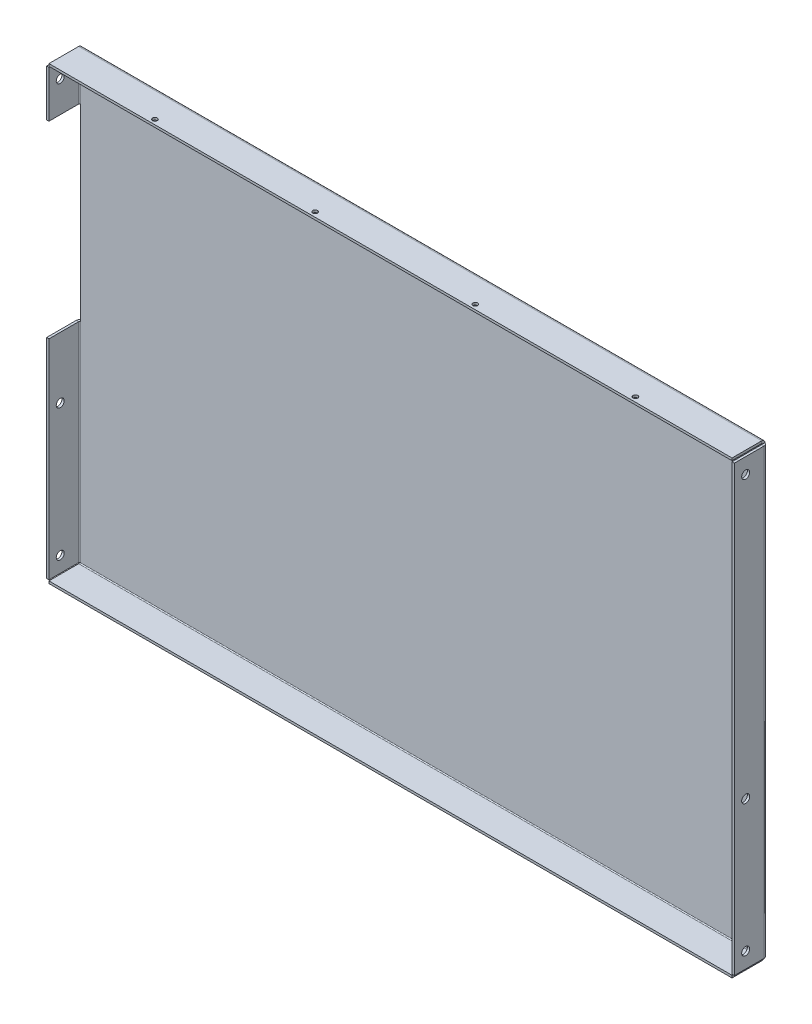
ISO-10303-21;
HEADER;
FILE_DESCRIPTION(('STEP AP214'),'2;1');
FILE_NAME('part.step','',(''),(''),'','','');
FILE_SCHEMA(('AUTOMOTIVE_DESIGN { 1 0 10303 214 1 1 1 1 }'));
ENDSEC;
DATA;
#1=APPLICATION_CONTEXT('core data for automotive mechanical design processes');
#2=APPLICATION_PROTOCOL_DEFINITION('international standard','automotive_design',2000,#1);
#3=PRODUCT_CONTEXT('',#1,'mechanical');
#4=PRODUCT('Part','Part','',(#3));
#5=PRODUCT_RELATED_PRODUCT_CATEGORY('part','',(#4));
#6=PRODUCT_DEFINITION_FORMATION('','',#4);
#7=PRODUCT_DEFINITION_CONTEXT('part definition',#1,'design');
#8=PRODUCT_DEFINITION('design','',#6,#7);
#9=PRODUCT_DEFINITION_SHAPE('','',#8);
#10=(LENGTH_UNIT() NAMED_UNIT(*) SI_UNIT(.MILLI.,.METRE.));
#11=(NAMED_UNIT(*) PLANE_ANGLE_UNIT() SI_UNIT($,.RADIAN.));
#12=(NAMED_UNIT(*) SI_UNIT($,.STERADIAN.) SOLID_ANGLE_UNIT());
#13=UNCERTAINTY_MEASURE_WITH_UNIT(LENGTH_MEASURE(1.E-05),#10,'distance_accuracy_value','');
#14=(GEOMETRIC_REPRESENTATION_CONTEXT(3) GLOBAL_UNCERTAINTY_ASSIGNED_CONTEXT((#13)) GLOBAL_UNIT_ASSIGNED_CONTEXT((#10,
#11,#12)) REPRESENTATION_CONTEXT('',''));
#15=CARTESIAN_POINT('',(0.,0.,0.));
#16=DIRECTION('',(0.,0.,1.));
#17=DIRECTION('',(1.,0.,0.));
#18=AXIS2_PLACEMENT_3D('',#15,#16,#17);
#19=CARTESIAN_POINT('',(-2.49999999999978,472.,2.49999999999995));
#20=DIRECTION('',(-1.,0.,0.));
#21=DIRECTION('',(0.,0.,1.));
#22=AXIS2_PLACEMENT_3D('',#19,#20,#21);
#23=PLANE('',#22);
#24=CARTESIAN_POINT('',(-2.50000000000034,17.5,23.0000000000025));
#25=DIRECTION('',(1.,0.,0.));
#26=DIRECTION('',(0.,0.,-1.));
#27=AXIS2_PLACEMENT_3D('',#24,#25,#26);
#28=CIRCLE('',#27,4.24999999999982);
#29=CARTESIAN_POINT('',(-2.50000000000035,17.5,18.7500000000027));
#30=VERTEX_POINT('',#29);
#31=EDGE_CURVE('E719',#30,#30,#28,.T.);
#32=ORIENTED_EDGE('',*,*,#31,.T.);
#33=EDGE_LOOP('',(#32));
#34=FACE_BOUND('',#33,.T.);
#35=CARTESIAN_POINT('',(-2.50000000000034,157.5,23.0000000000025));
#36=DIRECTION('',(1.,0.,0.));
#37=DIRECTION('',(0.,0.,-1.));
#38=AXIS2_PLACEMENT_3D('',#35,#36,#37);
#39=CIRCLE('',#38,4.24999999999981);
#40=CARTESIAN_POINT('',(-2.50000000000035,157.5,18.7500000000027));
#41=VERTEX_POINT('',#40);
#42=EDGE_CURVE('E585',#41,#41,#39,.T.);
#43=ORIENTED_EDGE('',*,*,#42,.T.);
#44=EDGE_LOOP('',(#43));
#45=FACE_BOUND('',#44,.T.);
#46=DIRECTION('',(0.,1.,0.));
#47=VECTOR('',#46,1.);
#48=CARTESIAN_POINT('',(-2.49999999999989,472.,35.));
#49=LINE('',#48,#47);
#50=CARTESIAN_POINT('',(-2.50000000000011,1.,35.));
#51=VERTEX_POINT('',#50);
#52=CARTESIAN_POINT('',(-2.5,222.5,35.));
#53=VERTEX_POINT('',#52);
#54=EDGE_CURVE('E639',#51,#53,#49,.T.);
#55=ORIENTED_EDGE('',*,*,#54,.T.);
#56=DIRECTION('',(0.,0.,1.));
#57=VECTOR('',#56,1.);
#58=CARTESIAN_POINT('',(-2.5,222.5,35.));
#59=LINE('',#58,#57);
#60=CARTESIAN_POINT('',(-2.49999999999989,222.5,3.49999999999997));
#61=VERTEX_POINT('',#60);
#62=EDGE_CURVE('E676',#61,#53,#59,.T.);
#63=ORIENTED_EDGE('',*,*,#62,.F.);
#64=DIRECTION('',(0.,-1.,0.));
#65=VECTOR('',#64,1.);
#66=CARTESIAN_POINT('',(-2.49999999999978,472.,3.49999999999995));
#67=LINE('',#66,#65);
#68=CARTESIAN_POINT('',(-2.5,1.,3.5));
#69=VERTEX_POINT('',#68);
#70=EDGE_CURVE('E616',#61,#69,#67,.T.);
#71=ORIENTED_EDGE('',*,*,#70,.T.);
#72=DIRECTION('',(0.,0.,1.));
#73=VECTOR('',#72,1.);
#74=CARTESIAN_POINT('',(-2.50000000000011,1.,35.));
#75=LINE('',#74,#73);
#76=EDGE_CURVE('E635',#69,#51,#75,.T.);
#77=ORIENTED_EDGE('',*,*,#76,.T.);
#78=EDGE_LOOP('',(#55,#63,#71,#77));
#79=FACE_BOUND('',#78,.T.);
#80=ADVANCED_FACE('F50',(#34,#45,#79),#23,.T.);
#81=CARTESIAN_POINT('',(-2.50000000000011,455.5,23.0000000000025));
#82=DIRECTION('',(1.,0.,0.));
#83=DIRECTION('',(0.,0.,-1.));
#84=AXIS2_PLACEMENT_3D('',#81,#82,#83);
#85=CIRCLE('',#84,4.24999999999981);
#86=CARTESIAN_POINT('',(-2.50000000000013,455.5,18.7500000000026));
#87=VERTEX_POINT('',#86);
#88=EDGE_CURVE('E581',#87,#87,#85,.T.);
#89=ORIENTED_EDGE('',*,*,#88,.T.);
#90=EDGE_LOOP('',(#89));
#91=FACE_BOUND('',#90,.T.);
#92=CARTESIAN_POINT('',(-2.49999999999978,472.,3.49999999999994));
#93=VERTEX_POINT('',#92);
#94=CARTESIAN_POINT('',(-2.49999999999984,422.5,3.49999999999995));
#95=VERTEX_POINT('',#94);
#96=EDGE_CURVE('E620',#93,#95,#67,.T.);
#97=ORIENTED_EDGE('',*,*,#96,.T.);
#98=DIRECTION('',(0.,0.,-1.));
#99=VECTOR('',#98,1.);
#100=CARTESIAN_POINT('',(-2.49999999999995,422.5,35.));
#101=LINE('',#100,#99);
#102=CARTESIAN_POINT('',(-2.49999999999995,422.5,35.));
#103=VERTEX_POINT('',#102);
#104=EDGE_CURVE('E276',#103,#95,#101,.T.);
#105=ORIENTED_EDGE('',*,*,#104,.F.);
#106=CARTESIAN_POINT('',(-2.49999999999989,472.,35.));
#107=VERTEX_POINT('',#106);
#108=EDGE_CURVE('E638',#103,#107,#49,.T.);
#109=ORIENTED_EDGE('',*,*,#108,.T.);
#110=DIRECTION('',(0.,0.,-1.));
#111=VECTOR('',#110,1.);
#112=CARTESIAN_POINT('',(-2.49999999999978,472.,2.49999999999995));
#113=LINE('',#112,#111);
#114=EDGE_CURVE('E642',#107,#93,#113,.T.);
#115=ORIENTED_EDGE('',*,*,#114,.T.);
#116=EDGE_LOOP('',(#97,#105,#109,#115));
#117=FACE_BOUND('',#116,.T.);
#118=ADVANCED_FACE('F750',(#91,#117),#23,.T.);
#119=CARTESIAN_POINT('',(1.00000000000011,1.,3.50000000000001));
#120=DIRECTION('',(0.,-1.,0.));
#121=DIRECTION('',(-1.,0.,0.));
#122=AXIS2_PLACEMENT_3D('',#119,#120,#121);
#123=CYLINDRICAL_SURFACE('',#122,3.49999999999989);
#124=ORIENTED_EDGE('',*,*,#70,.F.);
#125=CARTESIAN_POINT('',(1.00000000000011,222.5,3.49999999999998));
#126=DIRECTION('',(0.,-1.,0.));
#127=DIRECTION('',(0.,0.,-1.));
#128=AXIS2_PLACEMENT_3D('',#125,#126,#127);
#129=CIRCLE('',#128,3.49999999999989);
#130=CARTESIAN_POINT('',(1.00000000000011,222.5,0.));
#131=VERTEX_POINT('',#130);
#132=EDGE_CURVE('E926',#61,#131,#129,.T.);
#133=ORIENTED_EDGE('',*,*,#132,.T.);
#134=DIRECTION('',(0.,-1.,0.));
#135=VECTOR('',#134,1.);
#136=CARTESIAN_POINT('',(1.00000000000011,1.,1.17961196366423E-13));
#137=LINE('',#136,#135);
#138=CARTESIAN_POINT('',(1.00000000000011,1.,0.));
#139=VERTEX_POINT('',#138);
#140=EDGE_CURVE('E318',#139,#131,#137,.F.);
#141=ORIENTED_EDGE('',*,*,#140,.F.);
#142=CARTESIAN_POINT('',(1.00000000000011,1.,3.50000000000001));
#143=DIRECTION('',(0.,-1.,0.));
#144=DIRECTION('',(0.,0.,-1.));
#145=AXIS2_PLACEMENT_3D('',#142,#143,#144);
#146=CIRCLE('',#145,3.49999999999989);
#147=CARTESIAN_POINT('',(0.,1.,0.145898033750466));
#148=VERTEX_POINT('',#147);
#149=EDGE_CURVE('E11',#148,#139,#146,.T.);
#150=ORIENTED_EDGE('',*,*,#149,.F.);
#151=EDGE_CURVE('E62',#69,#148,#146,.T.);
#152=ORIENTED_EDGE('',*,*,#151,.F.);
#153=EDGE_LOOP('',(#124,#133,#141,#150,#152));
#154=FACE_BOUND('',#153,.T.);
#155=ADVANCED_FACE('F756',(#154),#123,.T.);
#156=CARTESIAN_POINT('',(1.00000000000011,422.5,0.));
#157=VERTEX_POINT('',#156);
#158=CARTESIAN_POINT('',(1.00000000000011,472.,0.));
#159=VERTEX_POINT('',#158);
#160=EDGE_CURVE('E323',#157,#159,#137,.F.);
#161=ORIENTED_EDGE('',*,*,#160,.F.);
#162=CARTESIAN_POINT('',(1.00000000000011,422.5,3.49999999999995));
#163=DIRECTION('',(0.,1.,0.));
#164=DIRECTION('',(-1.,0.,0.));
#165=AXIS2_PLACEMENT_3D('',#162,#163,#164);
#166=CIRCLE('',#165,3.49999999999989);
#167=EDGE_CURVE('E288',#157,#95,#166,.T.);
#168=ORIENTED_EDGE('',*,*,#167,.T.);
#169=ORIENTED_EDGE('',*,*,#96,.F.);
#170=CARTESIAN_POINT('',(1.00000000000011,472.,3.49999999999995));
#171=DIRECTION('',(0.,-1.,0.));
#172=DIRECTION('',(0.,0.,-1.));
#173=AXIS2_PLACEMENT_3D('',#170,#171,#172);
#174=CIRCLE('',#173,3.49999999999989);
#175=CARTESIAN_POINT('',(2.22044604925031E-13,472.,0.145898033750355));
#176=VERTEX_POINT('',#175);
#177=EDGE_CURVE('E322',#176,#93,#174,.F.);
#178=ORIENTED_EDGE('',*,*,#177,.F.);
#179=EDGE_CURVE('E77',#159,#176,#174,.F.);
#180=ORIENTED_EDGE('',*,*,#179,.F.);
#181=EDGE_LOOP('',(#161,#168,#169,#178,#180));
#182=FACE_BOUND('',#181,.T.);
#183=ADVANCED_FACE('F778',(#182),#123,.T.);
#184=CARTESIAN_POINT('',(1.00000000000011,1.,3.50000000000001));
#185=DIRECTION('',(0.,-1.,0.));
#186=DIRECTION('',(-1.,0.,0.));
#187=AXIS2_PLACEMENT_3D('',#184,#185,#186);
#188=CYLINDRICAL_SURFACE('',#187,0.999999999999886);
#189=CARTESIAN_POINT('',(1.00000000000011,222.5,3.49999999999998));
#190=DIRECTION('',(0.,-1.,0.));
#191=DIRECTION('',(0.,0.,-1.));
#192=AXIS2_PLACEMENT_3D('',#189,#190,#191);
#193=CIRCLE('',#192,0.999999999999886);
#194=CARTESIAN_POINT('',(2.22044604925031E-13,222.5,3.49999999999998));
#195=VERTEX_POINT('',#194);
#196=CARTESIAN_POINT('',(1.00000000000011,222.5,2.50000000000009));
#197=VERTEX_POINT('',#196);
#198=EDGE_CURVE('E265',#195,#197,#193,.T.);
#199=ORIENTED_EDGE('',*,*,#198,.F.);
#200=DIRECTION('',(0.,-1.,0.));
#201=VECTOR('',#200,1.);
#202=CARTESIAN_POINT('',(2.22044604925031E-13,472.,3.49999999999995));
#203=LINE('',#202,#201);
#204=CARTESIAN_POINT('',(2.22044604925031E-13,1.,3.5));
#205=VERTEX_POINT('',#204);
#206=EDGE_CURVE('E612',#195,#205,#203,.T.);
#207=ORIENTED_EDGE('',*,*,#206,.T.);
#208=CARTESIAN_POINT('',(1.00000000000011,1.,3.50000000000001));
#209=DIRECTION('',(0.,-1.,0.));
#210=DIRECTION('',(0.,0.,-1.));
#211=AXIS2_PLACEMENT_3D('',#208,#209,#210);
#212=CIRCLE('',#211,0.999999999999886);
#213=CARTESIAN_POINT('',(1.00000000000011,1.,2.50000000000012));
#214=VERTEX_POINT('',#213);
#215=EDGE_CURVE('E303',#205,#214,#212,.T.);
#216=ORIENTED_EDGE('',*,*,#215,.T.);
#217=DIRECTION('',(0.,-1.,0.));
#218=VECTOR('',#217,1.);
#219=CARTESIAN_POINT('',(1.00000000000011,1.,2.50000000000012));
#220=LINE('',#219,#218);
#221=EDGE_CURVE('E294',#214,#197,#220,.F.);
#222=ORIENTED_EDGE('',*,*,#221,.T.);
#223=EDGE_LOOP('',(#199,#207,#216,#222));
#224=FACE_BOUND('',#223,.T.);
#225=ADVANCED_FACE('F301',(#224),#188,.F.);
#226=CARTESIAN_POINT('',(1.00000000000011,422.5,3.49999999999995));
#227=DIRECTION('',(0.,-1.,0.));
#228=DIRECTION('',(0.,0.,-1.));
#229=AXIS2_PLACEMENT_3D('',#226,#227,#228);
#230=CIRCLE('',#229,0.999999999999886);
#231=CARTESIAN_POINT('',(1.00000000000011,422.5,2.50000000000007));
#232=VERTEX_POINT('',#231);
#233=CARTESIAN_POINT('',(2.22044604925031E-13,422.5,3.49999999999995));
#234=VERTEX_POINT('',#233);
#235=EDGE_CURVE('E277',#232,#234,#230,.F.);
#236=ORIENTED_EDGE('',*,*,#235,.F.);
#237=CARTESIAN_POINT('',(1.00000000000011,472.,2.50000000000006));
#238=VERTEX_POINT('',#237);
#239=EDGE_CURVE('E297',#232,#238,#220,.F.);
#240=ORIENTED_EDGE('',*,*,#239,.T.);
#241=CARTESIAN_POINT('',(1.00000000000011,472.,3.49999999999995));
#242=DIRECTION('',(0.,-1.,0.));
#243=DIRECTION('',(0.,0.,-1.));
#244=AXIS2_PLACEMENT_3D('',#241,#242,#243);
#245=CIRCLE('',#244,0.999999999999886);
#246=CARTESIAN_POINT('',(2.22044604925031E-13,472.,3.49999999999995));
#247=VERTEX_POINT('',#246);
#248=EDGE_CURVE('E305',#238,#247,#245,.F.);
#249=ORIENTED_EDGE('',*,*,#248,.T.);
#250=EDGE_CURVE('E607',#247,#234,#203,.T.);
#251=ORIENTED_EDGE('',*,*,#250,.T.);
#252=EDGE_LOOP('',(#236,#240,#249,#251));
#253=FACE_BOUND('',#252,.T.);
#254=ADVANCED_FACE('F777',(#253),#188,.F.);
#255=CARTESIAN_POINT('',(2.22044604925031E-13,472.,2.49999999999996));
#256=DIRECTION('',(-1.,0.,0.));
#257=DIRECTION('',(0.,0.,1.));
#258=AXIS2_PLACEMENT_3D('',#255,#256,#257);
#259=PLANE('',#258);
#260=CARTESIAN_POINT('',(0.,157.5,23.0000000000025));
#261=DIRECTION('',(-1.,0.,0.));
#262=DIRECTION('',(0.,0.,1.));
#263=AXIS2_PLACEMENT_3D('',#260,#261,#262);
#264=CIRCLE('',#263,4.24999999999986);
#265=CARTESIAN_POINT('',(0.,157.5,27.2500000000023));
#266=VERTEX_POINT('',#265);
#267=EDGE_CURVE('E570',#266,#266,#264,.T.);
#268=ORIENTED_EDGE('',*,*,#267,.T.);
#269=EDGE_LOOP('',(#268));
#270=FACE_BOUND('',#269,.T.);
#271=CARTESIAN_POINT('',(0.,17.5,23.0000000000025));
#272=DIRECTION('',(-1.,0.,0.));
#273=DIRECTION('',(0.,0.,1.));
#274=AXIS2_PLACEMENT_3D('',#271,#272,#273);
#275=CIRCLE('',#274,4.24999999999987);
#276=CARTESIAN_POINT('',(0.,17.5,27.2500000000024));
#277=VERTEX_POINT('',#276);
#278=EDGE_CURVE('E54',#277,#277,#275,.T.);
#279=ORIENTED_EDGE('',*,*,#278,.T.);
#280=EDGE_LOOP('',(#279));
#281=FACE_BOUND('',#280,.T.);
#282=DIRECTION('',(0.,0.,1.));
#283=VECTOR('',#282,1.);
#284=CARTESIAN_POINT('',(1.11022302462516E-13,222.5,2.49999999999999));
#285=LINE('',#284,#283);
#286=CARTESIAN_POINT('',(0.,222.5,35.));
#287=VERTEX_POINT('',#286);
#288=EDGE_CURVE('E665',#195,#287,#285,.T.);
#289=ORIENTED_EDGE('',*,*,#288,.T.);
#290=DIRECTION('',(0.,1.,0.));
#291=VECTOR('',#290,1.);
#292=CARTESIAN_POINT('',(1.11022302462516E-13,472.,35.));
#293=LINE('',#292,#291);
#294=CARTESIAN_POINT('',(-1.11022302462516E-13,1.,35.));
#295=VERTEX_POINT('',#294);
#296=EDGE_CURVE('E627',#295,#287,#293,.T.);
#297=ORIENTED_EDGE('',*,*,#296,.F.);
#298=DIRECTION('',(0.,0.,1.));
#299=VECTOR('',#298,1.);
#300=CARTESIAN_POINT('',(-1.11022302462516E-13,1.,35.));
#301=LINE('',#300,#299);
#302=EDGE_CURVE('E624',#205,#295,#301,.T.);
#303=ORIENTED_EDGE('',*,*,#302,.F.);
#304=ORIENTED_EDGE('',*,*,#206,.F.);
#305=EDGE_LOOP('',(#289,#297,#303,#304));
#306=FACE_BOUND('',#305,.T.);
#307=ADVANCED_FACE('F663',(#270,#281,#306),#259,.F.);
#308=CARTESIAN_POINT('',(1.66533453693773E-13,455.5,23.0000000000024));
#309=DIRECTION('',(-1.,0.,0.));
#310=DIRECTION('',(0.,0.,1.));
#311=AXIS2_PLACEMENT_3D('',#308,#309,#310);
#312=CIRCLE('',#311,4.24999999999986);
#313=CARTESIAN_POINT('',(1.51694649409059E-13,455.5,27.2500000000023));
#314=VERTEX_POINT('',#313);
#315=EDGE_CURVE('E565',#314,#314,#312,.T.);
#316=ORIENTED_EDGE('',*,*,#315,.T.);
#317=EDGE_LOOP('',(#316));
#318=FACE_BOUND('',#317,.T.);
#319=DIRECTION('',(0.,0.,1.));
#320=VECTOR('',#319,1.);
#321=CARTESIAN_POINT('',(1.66533453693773E-13,422.5,2.49999999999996));
#322=LINE('',#321,#320);
#323=CARTESIAN_POINT('',(0.,422.5,35.));
#324=VERTEX_POINT('',#323);
#325=EDGE_CURVE('E69',#324,#234,#322,.F.);
#326=ORIENTED_EDGE('',*,*,#325,.T.);
#327=ORIENTED_EDGE('',*,*,#250,.F.);
#328=DIRECTION('',(0.,0.,-1.));
#329=VECTOR('',#328,1.);
#330=CARTESIAN_POINT('',(2.22044604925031E-13,472.,2.49999999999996));
#331=LINE('',#330,#329);
#332=CARTESIAN_POINT('',(1.11022302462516E-13,472.,35.));
#333=VERTEX_POINT('',#332);
#334=EDGE_CURVE('E631',#333,#247,#331,.T.);
#335=ORIENTED_EDGE('',*,*,#334,.F.);
#336=EDGE_CURVE('E626',#324,#333,#293,.T.);
#337=ORIENTED_EDGE('',*,*,#336,.F.);
#338=EDGE_LOOP('',(#326,#327,#335,#337));
#339=FACE_BOUND('',#338,.T.);
#340=ADVANCED_FACE('F771',(#318,#339),#259,.F.);
#341=CARTESIAN_POINT('',(-2.49999999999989,472.,35.));
#342=DIRECTION('',(0.,0.,-1.));
#343=DIRECTION('',(-1.,0.,0.));
#344=AXIS2_PLACEMENT_3D('',#341,#342,#343);
#345=PLANE('',#344);
#346=DIRECTION('',(-1.,0.,0.));
#347=VECTOR('',#346,1.);
#348=CARTESIAN_POINT('',(-2.5,222.5,35.));
#349=LINE('',#348,#347);
#350=EDGE_CURVE('E673',#53,#287,#349,.F.);
#351=ORIENTED_EDGE('',*,*,#350,.F.);
#352=ORIENTED_EDGE('',*,*,#54,.F.);
#353=DIRECTION('',(1.,0.,0.));
#354=VECTOR('',#353,1.);
#355=CARTESIAN_POINT('',(-2.50000000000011,1.,35.));
#356=LINE('',#355,#354);
#357=EDGE_CURVE('E317',#51,#295,#356,.T.);
#358=ORIENTED_EDGE('',*,*,#357,.T.);
#359=ORIENTED_EDGE('',*,*,#296,.T.);
#360=EDGE_LOOP('',(#351,#352,#358,#359));
#361=FACE_BOUND('',#360,.T.);
#362=ADVANCED_FACE('F657',(#361),#345,.F.);
#363=DIRECTION('',(-1.,0.,0.));
#364=VECTOR('',#363,1.);
#365=CARTESIAN_POINT('',(-2.49999999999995,422.5,35.));
#366=LINE('',#365,#364);
#367=EDGE_CURVE('E668',#103,#324,#366,.F.);
#368=ORIENTED_EDGE('',*,*,#367,.T.);
#369=ORIENTED_EDGE('',*,*,#336,.T.);
#370=DIRECTION('',(1.,0.,0.));
#371=VECTOR('',#370,1.);
#372=CARTESIAN_POINT('',(-2.49999999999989,472.,35.));
#373=LINE('',#372,#371);
#374=EDGE_CURVE('E646',#107,#333,#373,.T.);
#375=ORIENTED_EDGE('',*,*,#374,.F.);
#376=ORIENTED_EDGE('',*,*,#108,.F.);
#377=EDGE_LOOP('',(#368,#369,#375,#376));
#378=FACE_BOUND('',#377,.T.);
#379=ADVANCED_FACE('F770',(#378),#345,.F.);
#380=CARTESIAN_POINT('',(725.,475.5,35.));
#381=DIRECTION('',(0.,-1.,0.));
#382=DIRECTION('',(0.,0.,-1.));
#383=AXIS2_PLACEMENT_3D('',#380,#381,#382);
#384=PLANE('',#383);
#385=CARTESIAN_POINT('',(277.5,475.5,30.));
#386=DIRECTION('',(0.,1.,0.));
#387=DIRECTION('',(0.,0.,1.));
#388=AXIS2_PLACEMENT_3D('',#385,#386,#387);
#389=CIRCLE('',#388,2.49999999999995);
#390=CARTESIAN_POINT('',(277.5,475.5,32.4999999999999));
#391=VERTEX_POINT('',#390);
#392=EDGE_CURVE('E695',#391,#391,#389,.T.);
#393=ORIENTED_EDGE('',*,*,#392,.F.);
#394=EDGE_LOOP('',(#393));
#395=FACE_BOUND('',#394,.T.);
#396=CARTESIAN_POINT('',(617.5,475.5,30.));
#397=DIRECTION('',(0.,1.,0.));
#398=DIRECTION('',(0.,0.,1.));
#399=AXIS2_PLACEMENT_3D('',#396,#397,#398);
#400=CIRCLE('',#399,2.49999999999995);
#401=CARTESIAN_POINT('',(617.5,475.5,32.4999999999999));
#402=VERTEX_POINT('',#401);
#403=EDGE_CURVE('E711',#402,#402,#400,.T.);
#404=ORIENTED_EDGE('',*,*,#403,.F.);
#405=EDGE_LOOP('',(#404));
#406=FACE_BOUND('',#405,.T.);
#407=DIRECTION('',(1.,0.,0.));
#408=VECTOR('',#407,1.);
#409=CARTESIAN_POINT('',(725.,475.5,3.49999999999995));
#410=LINE('',#409,#408);
#411=CARTESIAN_POINT('',(2.22044604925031E-13,475.5,3.49999999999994));
#412=VERTEX_POINT('',#411);
#413=CARTESIAN_POINT('',(725.,475.5,3.49999999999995));
#414=VERTEX_POINT('',#413);
#415=EDGE_CURVE('E496',#412,#414,#410,.T.);
#416=ORIENTED_EDGE('',*,*,#415,.F.);
#417=DIRECTION('',(0.,0.,1.));
#418=VECTOR('',#417,1.);
#419=CARTESIAN_POINT('',(0.,475.5,35.));
#420=LINE('',#419,#418);
#421=CARTESIAN_POINT('',(0.,475.5,35.));
#422=VERTEX_POINT('',#421);
#423=EDGE_CURVE('E516',#412,#422,#420,.T.);
#424=ORIENTED_EDGE('',*,*,#423,.T.);
#425=DIRECTION('',(1.,0.,0.));
#426=VECTOR('',#425,1.);
#427=CARTESIAN_POINT('',(725.,475.5,35.));
#428=LINE('',#427,#426);
#429=CARTESIAN_POINT('',(725.,475.5,35.));
#430=VERTEX_POINT('',#429);
#431=EDGE_CURVE('E519',#422,#430,#428,.T.);
#432=ORIENTED_EDGE('',*,*,#431,.T.);
#433=DIRECTION('',(0.,0.,-1.));
#434=VECTOR('',#433,1.);
#435=CARTESIAN_POINT('',(725.,475.5,2.49999999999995));
#436=LINE('',#435,#434);
#437=EDGE_CURVE('E512',#430,#414,#436,.T.);
#438=ORIENTED_EDGE('',*,*,#437,.T.);
#439=EDGE_LOOP('',(#416,#424,#432,#438));
#440=FACE_BOUND('',#439,.T.);
#441=CARTESIAN_POINT('',(447.5,475.5,30.));
#442=DIRECTION('',(0.,1.,0.));
#443=DIRECTION('',(0.,0.,1.));
#444=AXIS2_PLACEMENT_3D('',#441,#442,#443);
#445=CIRCLE('',#444,2.49999999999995);
#446=CARTESIAN_POINT('',(447.5,475.5,32.4999999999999));
#447=VERTEX_POINT('',#446);
#448=EDGE_CURVE('E703',#447,#447,#445,.T.);
#449=ORIENTED_EDGE('',*,*,#448,.F.);
#450=EDGE_LOOP('',(#449));
#451=FACE_BOUND('',#450,.T.);
#452=CARTESIAN_POINT('',(107.5,475.5,30.));
#453=DIRECTION('',(0.,1.,0.));
#454=DIRECTION('',(0.,0.,1.));
#455=AXIS2_PLACEMENT_3D('',#452,#453,#454);
#456=CIRCLE('',#455,2.49999999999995);
#457=CARTESIAN_POINT('',(107.5,475.5,32.4999999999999));
#458=VERTEX_POINT('',#457);
#459=EDGE_CURVE('E686',#458,#458,#456,.T.);
#460=ORIENTED_EDGE('',*,*,#459,.F.);
#461=EDGE_LOOP('',(#460));
#462=FACE_BOUND('',#461,.T.);
#463=ADVANCED_FACE('F794',(#395,#406,#440,#451,#462),#384,.F.);
#464=CARTESIAN_POINT('',(1.00000000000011,472.,2.50000000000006));
#465=DIRECTION('',(0.,-1.,0.));
#466=DIRECTION('',(0.,0.,-1.));
#467=AXIS2_PLACEMENT_3D('',#464,#465,#466);
#468=PLANE('',#467);
#469=DIRECTION('',(-1.,0.,0.));
#470=VECTOR('',#469,1.);
#471=CARTESIAN_POINT('',(0.,472.,0.));
#472=LINE('',#471,#470);
#473=CARTESIAN_POINT('',(2.22044604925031E-13,472.,0.));
#474=VERTEX_POINT('',#473);
#475=EDGE_CURVE('E544',#474,#159,#472,.F.);
#476=ORIENTED_EDGE('',*,*,#475,.T.);
#477=ORIENTED_EDGE('',*,*,#179,.T.);
#478=DIRECTION('',(0.,0.,-1.));
#479=VECTOR('',#478,1.);
#480=CARTESIAN_POINT('',(2.22044604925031E-13,472.,2.49999999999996));
#481=LINE('',#480,#479);
#482=EDGE_CURVE('E552',#176,#474,#481,.T.);
#483=ORIENTED_EDGE('',*,*,#482,.T.);
#484=EDGE_LOOP('',(#476,#477,#483));
#485=FACE_BOUND('',#484,.T.);
#486=ADVANCED_FACE('F790',(#485),#468,.T.);
#487=CARTESIAN_POINT('',(0.,1.,2.5));
#488=DIRECTION('',(0.,1.,0.));
#489=DIRECTION('',(0.,0.,1.));
#490=AXIS2_PLACEMENT_3D('',#487,#488,#489);
#491=PLANE('',#490);
#492=DIRECTION('',(0.,0.,-1.));
#493=VECTOR('',#492,1.);
#494=CARTESIAN_POINT('',(0.,1.,2.5));
#495=LINE('',#494,#493);
#496=CARTESIAN_POINT('',(0.,1.,0.));
#497=VERTEX_POINT('',#496);
#498=EDGE_CURVE('E484',#148,#497,#495,.T.);
#499=ORIENTED_EDGE('',*,*,#498,.F.);
#500=ORIENTED_EDGE('',*,*,#149,.T.);
#501=DIRECTION('',(1.,0.,0.));
#502=VECTOR('',#501,1.);
#503=CARTESIAN_POINT('',(725.,1.0000000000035,0.));
#504=LINE('',#503,#502);
#505=EDGE_CURVE('E331',#497,#139,#504,.T.);
#506=ORIENTED_EDGE('',*,*,#505,.F.);
#507=EDGE_LOOP('',(#499,#500,#506));
#508=FACE_BOUND('',#507,.T.);
#509=ADVANCED_FACE('F793',(#508),#491,.T.);
#510=CARTESIAN_POINT('',(0.,473.,2.49999999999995));
#511=DIRECTION('',(0.,0.,-1.));
#512=DIRECTION('',(-1.,0.,0.));
#513=AXIS2_PLACEMENT_3D('',#510,#511,#512);
#514=PLANE('',#513);
#515=ORIENTED_EDGE('',*,*,#221,.F.);
#516=DIRECTION('',(1.,0.,0.));
#517=VECTOR('',#516,1.);
#518=CARTESIAN_POINT('',(725.,1.,2.5));
#519=LINE('',#518,#517);
#520=CARTESIAN_POINT('',(724.,1.,2.5));
#521=VERTEX_POINT('',#520);
#522=EDGE_CURVE('E464',#521,#214,#519,.F.);
#523=ORIENTED_EDGE('',*,*,#522,.F.);
#524=DIRECTION('',(0.,1.,0.));
#525=VECTOR('',#524,1.);
#526=CARTESIAN_POINT('',(724.,472.,2.50000000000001));
#527=LINE('',#526,#525);
#528=CARTESIAN_POINT('',(724.,472.,2.50000000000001));
#529=VERTEX_POINT('',#528);
#530=EDGE_CURVE('E385',#529,#521,#527,.F.);
#531=ORIENTED_EDGE('',*,*,#530,.F.);
#532=DIRECTION('',(-1.,0.,0.));
#533=VECTOR('',#532,1.);
#534=CARTESIAN_POINT('',(0.,472.,2.49999999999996));
#535=LINE('',#534,#533);
#536=EDGE_CURVE('E540',#238,#529,#535,.F.);
#537=ORIENTED_EDGE('',*,*,#536,.F.);
#538=ORIENTED_EDGE('',*,*,#239,.F.);
#539=DIRECTION('',(0.,-1.,0.));
#540=VECTOR('',#539,1.);
#541=CARTESIAN_POINT('',(1.00000000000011,1.,2.50000000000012));
#542=LINE('',#541,#540);
#543=EDGE_CURVE('E283',#197,#232,#542,.F.);
#544=ORIENTED_EDGE('',*,*,#543,.F.);
#545=EDGE_LOOP('',(#515,#523,#531,#537,#538,#544));
#546=FACE_BOUND('',#545,.T.);
#547=ADVANCED_FACE('F52',(#546),#514,.F.);
#548=CARTESIAN_POINT('',(0.,473.,0.));
#549=DIRECTION('',(0.,0.,-1.));
#550=DIRECTION('',(-1.,0.,0.));
#551=AXIS2_PLACEMENT_3D('',#548,#549,#550);
#552=PLANE('',#551);
#553=DIRECTION('',(1.,0.,0.));
#554=VECTOR('',#553,1.);
#555=CARTESIAN_POINT('',(725.,1.,0.));
#556=LINE('',#555,#554);
#557=CARTESIAN_POINT('',(724.,1.,0.));
#558=VERTEX_POINT('',#557);
#559=EDGE_CURVE('E471',#558,#139,#556,.F.);
#560=ORIENTED_EDGE('',*,*,#559,.T.);
#561=ORIENTED_EDGE('',*,*,#140,.T.);
#562=DIRECTION('',(0.,-1.,0.));
#563=VECTOR('',#562,1.);
#564=CARTESIAN_POINT('',(1.00000000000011,1.,1.17961196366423E-13));
#565=LINE('',#564,#563);
#566=EDGE_CURVE('E286',#131,#157,#565,.F.);
#567=ORIENTED_EDGE('',*,*,#566,.T.);
#568=ORIENTED_EDGE('',*,*,#160,.T.);
#569=CARTESIAN_POINT('',(724.,472.,0.));
#570=VERTEX_POINT('',#569);
#571=EDGE_CURVE('E548',#159,#570,#472,.F.);
#572=ORIENTED_EDGE('',*,*,#571,.T.);
#573=DIRECTION('',(0.,1.,0.));
#574=VECTOR('',#573,1.);
#575=CARTESIAN_POINT('',(724.,472.,0.));
#576=LINE('',#575,#574);
#577=EDGE_CURVE('E392',#570,#558,#576,.F.);
#578=ORIENTED_EDGE('',*,*,#577,.T.);
#579=EDGE_LOOP('',(#560,#561,#567,#568,#572,#578));
#580=FACE_BOUND('',#579,.T.);
#581=ADVANCED_FACE('F842',(#580),#552,.T.);
#582=CARTESIAN_POINT('',(725.,472.,2.49999999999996));
#583=DIRECTION('',(1.11022302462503E-13,-1.,0.));
#584=DIRECTION('',(1.,1.11022302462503E-13,0.));
#585=AXIS2_PLACEMENT_3D('',#582,#583,#584);
#586=PLANE('',#585);
#587=DIRECTION('',(0.,0.,-1.));
#588=VECTOR('',#587,1.);
#589=CARTESIAN_POINT('',(725.,472.,2.49999999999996));
#590=LINE('',#589,#588);
#591=CARTESIAN_POINT('',(725.,472.,0.145898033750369));
#592=VERTEX_POINT('',#591);
#593=CARTESIAN_POINT('',(725.,472.,0.));
#594=VERTEX_POINT('',#593);
#595=EDGE_CURVE('E560',#592,#594,#590,.T.);
#596=ORIENTED_EDGE('',*,*,#595,.F.);
#597=CARTESIAN_POINT('',(724.,472.,3.4999999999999));
#598=DIRECTION('',(0.,1.,0.));
#599=DIRECTION('',(0.,0.,1.));
#600=AXIS2_PLACEMENT_3D('',#597,#598,#599);
#601=CIRCLE('',#600,3.49999999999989);
#602=EDGE_CURVE('E60',#592,#570,#601,.T.);
#603=ORIENTED_EDGE('',*,*,#602,.T.);
#604=DIRECTION('',(-1.,0.,0.));
#605=VECTOR('',#604,1.);
#606=CARTESIAN_POINT('',(0.,471.99999999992,0.));
#607=LINE('',#606,#605);
#608=EDGE_CURVE('E408',#594,#570,#607,.T.);
#609=ORIENTED_EDGE('',*,*,#608,.F.);
#610=EDGE_LOOP('',(#596,#603,#609));
#611=FACE_BOUND('',#610,.T.);
#612=ADVANCED_FACE('F838',(#611),#586,.T.);
#613=CARTESIAN_POINT('',(724.,1.,2.50000000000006));
#614=DIRECTION('',(0.,1.,0.));
#615=DIRECTION('',(0.,0.,1.));
#616=AXIS2_PLACEMENT_3D('',#613,#614,#615);
#617=PLANE('',#616);
#618=CARTESIAN_POINT('',(725.,1.,0.));
#619=VERTEX_POINT('',#618);
#620=EDGE_CURVE('E468',#619,#558,#556,.F.);
#621=ORIENTED_EDGE('',*,*,#620,.T.);
#622=CARTESIAN_POINT('',(724.,1.,3.49999999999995));
#623=DIRECTION('',(0.,1.,0.));
#624=DIRECTION('',(0.,0.,1.));
#625=AXIS2_PLACEMENT_3D('',#622,#623,#624);
#626=CIRCLE('',#625,3.49999999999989);
#627=CARTESIAN_POINT('',(725.,1.,0.145898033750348));
#628=VERTEX_POINT('',#627);
#629=EDGE_CURVE('E397',#558,#628,#626,.F.);
#630=ORIENTED_EDGE('',*,*,#629,.T.);
#631=DIRECTION('',(0.,0.,-1.));
#632=VECTOR('',#631,1.);
#633=CARTESIAN_POINT('',(725.,1.,2.5));
#634=LINE('',#633,#632);
#635=EDGE_CURVE('E475',#628,#619,#634,.T.);
#636=ORIENTED_EDGE('',*,*,#635,.T.);
#637=EDGE_LOOP('',(#621,#630,#636));
#638=FACE_BOUND('',#637,.T.);
#639=ADVANCED_FACE('F834',(#638),#617,.T.);
#640=CARTESIAN_POINT('',(725.,472.,3.49999999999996));
#641=DIRECTION('',(1.,0.,0.));
#642=DIRECTION('',(0.,0.,-1.));
#643=AXIS2_PLACEMENT_3D('',#640,#641,#642);
#644=PLANE('',#643);
#645=DIRECTION('',(0.,1.,0.));
#646=VECTOR('',#645,1.);
#647=CARTESIAN_POINT('',(725.,473.,3.49999999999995));
#648=LINE('',#647,#646);
#649=CARTESIAN_POINT('',(725.,473.,3.49999999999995));
#650=VERTEX_POINT('',#649);
#651=EDGE_CURVE('E483',#650,#414,#648,.T.);
#652=ORIENTED_EDGE('',*,*,#651,.F.);
#653=CARTESIAN_POINT('',(725.,472.,3.49999999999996));
#654=DIRECTION('',(-1.,0.,0.));
#655=DIRECTION('',(0.,0.,1.));
#656=AXIS2_PLACEMENT_3D('',#653,#654,#655);
#657=CIRCLE('',#656,1.);
#658=CARTESIAN_POINT('',(725.,472.,2.49999999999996));
#659=VERTEX_POINT('',#658);
#660=EDGE_CURVE('E531',#659,#650,#657,.F.);
#661=ORIENTED_EDGE('',*,*,#660,.F.);
#662=EDGE_CURVE('E556',#659,#592,#590,.T.);
#663=ORIENTED_EDGE('',*,*,#662,.T.);
#664=ORIENTED_EDGE('',*,*,#595,.T.);
#665=CARTESIAN_POINT('',(725.,472.,3.49999999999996));
#666=DIRECTION('',(-1.,0.,0.));
#667=DIRECTION('',(0.,0.,1.));
#668=AXIS2_PLACEMENT_3D('',#665,#666,#667);
#669=CIRCLE('',#668,3.5);
#670=EDGE_CURVE('E547',#594,#414,#669,.F.);
#671=ORIENTED_EDGE('',*,*,#670,.T.);
#672=EDGE_LOOP('',(#652,#661,#663,#664,#671));
#673=FACE_BOUND('',#672,.T.);
#674=ADVANCED_FACE('F837',(#673),#644,.T.);
#675=CARTESIAN_POINT('',(2.22044604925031E-13,472.,3.49999999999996));
#676=DIRECTION('',(1.,0.,0.));
#677=DIRECTION('',(0.,0.,-1.));
#678=AXIS2_PLACEMENT_3D('',#675,#676,#677);
#679=PLANE('',#678);
#680=CARTESIAN_POINT('',(2.22044604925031E-13,472.,3.49999999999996));
#681=DIRECTION('',(-1.,0.,0.));
#682=DIRECTION('',(0.,0.,1.));
#683=AXIS2_PLACEMENT_3D('',#680,#681,#682);
#684=CIRCLE('',#683,1.);
#685=CARTESIAN_POINT('',(2.22044604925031E-13,473.,3.49999999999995));
#686=VERTEX_POINT('',#685);
#687=CARTESIAN_POINT('',(2.22044604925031E-13,472.,2.49999999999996));
#688=VERTEX_POINT('',#687);
#689=EDGE_CURVE('E530',#686,#688,#684,.T.);
#690=ORIENTED_EDGE('',*,*,#689,.F.);
#691=DIRECTION('',(0.,1.,0.));
#692=VECTOR('',#691,1.);
#693=CARTESIAN_POINT('',(2.22044604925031E-13,473.,3.49999999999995));
#694=LINE('',#693,#692);
#695=EDGE_CURVE('E492',#686,#412,#694,.T.);
#696=ORIENTED_EDGE('',*,*,#695,.T.);
#697=CARTESIAN_POINT('',(2.22044604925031E-13,472.,3.49999999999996));
#698=DIRECTION('',(-1.,0.,0.));
#699=DIRECTION('',(0.,0.,1.));
#700=AXIS2_PLACEMENT_3D('',#697,#698,#699);
#701=CIRCLE('',#700,3.5);
#702=EDGE_CURVE('E535',#412,#474,#701,.T.);
#703=ORIENTED_EDGE('',*,*,#702,.T.);
#704=ORIENTED_EDGE('',*,*,#482,.F.);
#705=EDGE_CURVE('E561',#688,#176,#481,.T.);
#706=ORIENTED_EDGE('',*,*,#705,.F.);
#707=EDGE_LOOP('',(#690,#696,#703,#704,#706));
#708=FACE_BOUND('',#707,.T.);
#709=ADVANCED_FACE('F903',(#708),#679,.F.);
#710=CARTESIAN_POINT('',(0.,472.,3.49999999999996));
#711=DIRECTION('',(-1.,0.,0.));
#712=DIRECTION('',(0.,1.,0.));
#713=AXIS2_PLACEMENT_3D('',#710,#711,#712);
#714=CYLINDRICAL_SURFACE('',#713,3.5);
#715=ORIENTED_EDGE('',*,*,#475,.F.);
#716=ORIENTED_EDGE('',*,*,#702,.F.);
#717=ORIENTED_EDGE('',*,*,#415,.T.);
#718=ORIENTED_EDGE('',*,*,#670,.F.);
#719=ORIENTED_EDGE('',*,*,#608,.T.);
#720=ORIENTED_EDGE('',*,*,#571,.F.);
#721=EDGE_LOOP('',(#715,#716,#717,#718,#719,#720));
#722=FACE_BOUND('',#721,.T.);
#723=ADVANCED_FACE('F901',(#722),#714,.T.);
#724=CARTESIAN_POINT('',(0.,472.,3.49999999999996));
#725=DIRECTION('',(-1.,0.,0.));
#726=DIRECTION('',(0.,1.,0.));
#727=AXIS2_PLACEMENT_3D('',#724,#725,#726);
#728=CYLINDRICAL_SURFACE('',#727,1.);
#729=EDGE_CURVE('E536',#688,#238,#535,.F.);
#730=ORIENTED_EDGE('',*,*,#729,.T.);
#731=ORIENTED_EDGE('',*,*,#536,.T.);
#732=DIRECTION('',(-1.,-1.11022302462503E-13,0.));
#733=VECTOR('',#732,1.);
#734=CARTESIAN_POINT('',(725.,472.,2.49999999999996));
#735=LINE('',#734,#733);
#736=EDGE_CURVE('E401',#659,#529,#735,.T.);
#737=ORIENTED_EDGE('',*,*,#736,.F.);
#738=ORIENTED_EDGE('',*,*,#660,.T.);
#739=DIRECTION('',(-1.,0.,0.));
#740=VECTOR('',#739,1.);
#741=CARTESIAN_POINT('',(725.,473.,3.49999999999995));
#742=LINE('',#741,#740);
#743=EDGE_CURVE('E489',#650,#686,#742,.T.);
#744=ORIENTED_EDGE('',*,*,#743,.T.);
#745=ORIENTED_EDGE('',*,*,#689,.T.);
#746=EDGE_LOOP('',(#730,#731,#737,#738,#744,#745));
#747=FACE_BOUND('',#746,.T.);
#748=ADVANCED_FACE('F897',(#747),#728,.F.);
#749=CARTESIAN_POINT('',(725.,475.5,2.49999999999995));
#750=DIRECTION('',(-1.,0.,0.));
#751=DIRECTION('',(0.,0.,1.));
#752=AXIS2_PLACEMENT_3D('',#749,#750,#751);
#753=PLANE('',#752);
#754=ORIENTED_EDGE('',*,*,#651,.T.);
#755=ORIENTED_EDGE('',*,*,#437,.F.);
#756=DIRECTION('',(0.,-1.,0.));
#757=VECTOR('',#756,1.);
#758=CARTESIAN_POINT('',(725.,475.5,35.));
#759=LINE('',#758,#757);
#760=CARTESIAN_POINT('',(725.,473.,35.));
#761=VERTEX_POINT('',#760);
#762=EDGE_CURVE('E522',#430,#761,#759,.T.);
#763=ORIENTED_EDGE('',*,*,#762,.T.);
#764=DIRECTION('',(0.,0.,-1.));
#765=VECTOR('',#764,1.);
#766=CARTESIAN_POINT('',(725.,473.,2.49999999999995));
#767=LINE('',#766,#765);
#768=EDGE_CURVE('E502',#761,#650,#767,.T.);
#769=ORIENTED_EDGE('',*,*,#768,.T.);
#770=EDGE_LOOP('',(#754,#755,#763,#769));
#771=FACE_BOUND('',#770,.T.);
#772=ADVANCED_FACE('F893',(#771),#753,.F.);
#773=CARTESIAN_POINT('',(0.,475.5,35.));
#774=DIRECTION('',(1.,0.,0.));
#775=DIRECTION('',(0.,0.,-1.));
#776=AXIS2_PLACEMENT_3D('',#773,#774,#775);
#777=PLANE('',#776);
#778=ORIENTED_EDGE('',*,*,#695,.F.);
#779=DIRECTION('',(0.,0.,1.));
#780=VECTOR('',#779,1.);
#781=CARTESIAN_POINT('',(0.,473.,35.));
#782=LINE('',#781,#780);
#783=CARTESIAN_POINT('',(0.,473.,35.));
#784=VERTEX_POINT('',#783);
#785=EDGE_CURVE('E506',#686,#784,#782,.T.);
#786=ORIENTED_EDGE('',*,*,#785,.T.);
#787=DIRECTION('',(0.,-1.,0.));
#788=VECTOR('',#787,1.);
#789=CARTESIAN_POINT('',(0.,475.5,35.));
#790=LINE('',#789,#788);
#791=EDGE_CURVE('E526',#422,#784,#790,.T.);
#792=ORIENTED_EDGE('',*,*,#791,.F.);
#793=ORIENTED_EDGE('',*,*,#423,.F.);
#794=EDGE_LOOP('',(#778,#786,#792,#793));
#795=FACE_BOUND('',#794,.T.);
#796=ADVANCED_FACE('F883',(#795),#777,.F.);
#797=CARTESIAN_POINT('',(725.,473.,35.));
#798=DIRECTION('',(0.,-1.,0.));
#799=DIRECTION('',(0.,0.,-1.));
#800=AXIS2_PLACEMENT_3D('',#797,#798,#799);
#801=PLANE('',#800);
#802=CARTESIAN_POINT('',(107.5,473.,30.));
#803=DIRECTION('',(0.,-1.,0.));
#804=DIRECTION('',(0.,0.,-1.));
#805=AXIS2_PLACEMENT_3D('',#802,#803,#804);
#806=CIRCLE('',#805,2.49999999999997);
#807=CARTESIAN_POINT('',(107.5,473.,27.5));
#808=VERTEX_POINT('',#807);
#809=EDGE_CURVE('E691',#808,#808,#806,.T.);
#810=ORIENTED_EDGE('',*,*,#809,.F.);
#811=EDGE_LOOP('',(#810));
#812=FACE_BOUND('',#811,.T.);
#813=CARTESIAN_POINT('',(277.5,473.,30.));
#814=DIRECTION('',(0.,-1.,0.));
#815=DIRECTION('',(0.,0.,-1.));
#816=AXIS2_PLACEMENT_3D('',#813,#814,#815);
#817=CIRCLE('',#816,2.49999999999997);
#818=CARTESIAN_POINT('',(277.5,473.,27.5));
#819=VERTEX_POINT('',#818);
#820=EDGE_CURVE('E699',#819,#819,#817,.T.);
#821=ORIENTED_EDGE('',*,*,#820,.F.);
#822=EDGE_LOOP('',(#821));
#823=FACE_BOUND('',#822,.T.);
#824=CARTESIAN_POINT('',(447.5,473.,30.));
#825=DIRECTION('',(0.,-1.,0.));
#826=DIRECTION('',(0.,0.,-1.));
#827=AXIS2_PLACEMENT_3D('',#824,#825,#826);
#828=CIRCLE('',#827,2.49999999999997);
#829=CARTESIAN_POINT('',(447.5,473.,27.5));
#830=VERTEX_POINT('',#829);
#831=EDGE_CURVE('E707',#830,#830,#828,.T.);
#832=ORIENTED_EDGE('',*,*,#831,.F.);
#833=EDGE_LOOP('',(#832));
#834=FACE_BOUND('',#833,.T.);
#835=CARTESIAN_POINT('',(617.5,473.,30.));
#836=DIRECTION('',(0.,-1.,0.));
#837=DIRECTION('',(0.,0.,-1.));
#838=AXIS2_PLACEMENT_3D('',#835,#836,#837);
#839=CIRCLE('',#838,2.49999999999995);
#840=CARTESIAN_POINT('',(617.5,473.,27.5));
#841=VERTEX_POINT('',#840);
#842=EDGE_CURVE('E715',#841,#841,#839,.T.);
#843=ORIENTED_EDGE('',*,*,#842,.F.);
#844=EDGE_LOOP('',(#843));
#845=FACE_BOUND('',#844,.T.);
#846=ORIENTED_EDGE('',*,*,#785,.F.);
#847=ORIENTED_EDGE('',*,*,#743,.F.);
#848=ORIENTED_EDGE('',*,*,#768,.F.);
#849=DIRECTION('',(1.,0.,0.));
#850=VECTOR('',#849,1.);
#851=CARTESIAN_POINT('',(725.,473.,35.));
#852=LINE('',#851,#850);
#853=EDGE_CURVE('E509',#784,#761,#852,.T.);
#854=ORIENTED_EDGE('',*,*,#853,.F.);
#855=EDGE_LOOP('',(#846,#847,#848,#854));
#856=FACE_BOUND('',#855,.T.);
#857=ADVANCED_FACE('F880',(#812,#823,#834,#845,#856),#801,.T.);
#858=CARTESIAN_POINT('',(725.,475.5,35.));
#859=DIRECTION('',(0.,0.,-1.));
#860=DIRECTION('',(0.,1.,0.));
#861=AXIS2_PLACEMENT_3D('',#858,#859,#860);
#862=PLANE('',#861);
#863=ORIENTED_EDGE('',*,*,#853,.T.);
#864=ORIENTED_EDGE('',*,*,#762,.F.);
#865=ORIENTED_EDGE('',*,*,#431,.F.);
#866=ORIENTED_EDGE('',*,*,#791,.T.);
#867=EDGE_LOOP('',(#863,#864,#865,#866));
#868=FACE_BOUND('',#867,.T.);
#869=ADVANCED_FACE('F875',(#868),#862,.F.);
#870=CARTESIAN_POINT('',(0.,1.,3.5));
#871=DIRECTION('',(-1.,0.,0.));
#872=DIRECTION('',(0.,0.,1.));
#873=AXIS2_PLACEMENT_3D('',#870,#871,#872);
#874=PLANE('',#873);
#875=DIRECTION('',(0.,-1.,0.));
#876=VECTOR('',#875,1.);
#877=CARTESIAN_POINT('',(0.,0.,3.5));
#878=LINE('',#877,#876);
#879=CARTESIAN_POINT('',(0.,0.,3.5));
#880=VERTEX_POINT('',#879);
#881=CARTESIAN_POINT('',(0.,-2.5,3.49999999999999));
#882=VERTEX_POINT('',#881);
#883=EDGE_CURVE('E412',#880,#882,#878,.T.);
#884=ORIENTED_EDGE('',*,*,#883,.F.);
#885=CARTESIAN_POINT('',(0.,1.,3.5));
#886=DIRECTION('',(1.,0.,0.));
#887=DIRECTION('',(0.,0.,-1.));
#888=AXIS2_PLACEMENT_3D('',#885,#886,#887);
#889=CIRCLE('',#888,1.);
#890=CARTESIAN_POINT('',(0.,1.,2.5));
#891=VERTEX_POINT('',#890);
#892=EDGE_CURVE('E455',#891,#880,#889,.F.);
#893=ORIENTED_EDGE('',*,*,#892,.F.);
#894=EDGE_CURVE('E479',#891,#148,#495,.T.);
#895=ORIENTED_EDGE('',*,*,#894,.T.);
#896=ORIENTED_EDGE('',*,*,#498,.T.);
#897=CARTESIAN_POINT('',(0.,1.,3.5));
#898=DIRECTION('',(1.,0.,0.));
#899=DIRECTION('',(0.,0.,-1.));
#900=AXIS2_PLACEMENT_3D('',#897,#898,#899);
#901=CIRCLE('',#900,3.5);
#902=EDGE_CURVE('E470',#497,#882,#901,.F.);
#903=ORIENTED_EDGE('',*,*,#902,.T.);
#904=EDGE_LOOP('',(#884,#893,#895,#896,#903));
#905=FACE_BOUND('',#904,.T.);
#906=ADVANCED_FACE('F872',(#905),#874,.T.);
#907=CARTESIAN_POINT('',(725.,1.,3.5));
#908=DIRECTION('',(-1.,0.,0.));
#909=DIRECTION('',(0.,0.,1.));
#910=AXIS2_PLACEMENT_3D('',#907,#908,#909);
#911=PLANE('',#910);
#912=CARTESIAN_POINT('',(725.,1.,3.5));
#913=DIRECTION('',(1.,0.,0.));
#914=DIRECTION('',(0.,0.,-1.));
#915=AXIS2_PLACEMENT_3D('',#912,#913,#914);
#916=CIRCLE('',#915,1.);
#917=CARTESIAN_POINT('',(725.,0.,3.5));
#918=VERTEX_POINT('',#917);
#919=CARTESIAN_POINT('',(725.,1.,2.5));
#920=VERTEX_POINT('',#919);
#921=EDGE_CURVE('E454',#918,#920,#916,.T.);
#922=ORIENTED_EDGE('',*,*,#921,.F.);
#923=DIRECTION('',(0.,-1.,0.));
#924=VECTOR('',#923,1.);
#925=CARTESIAN_POINT('',(725.,0.,3.5));
#926=LINE('',#925,#924);
#927=CARTESIAN_POINT('',(725.,-2.5,3.49999999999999));
#928=VERTEX_POINT('',#927);
#929=EDGE_CURVE('E416',#918,#928,#926,.T.);
#930=ORIENTED_EDGE('',*,*,#929,.T.);
#931=CARTESIAN_POINT('',(725.,1.,3.5));
#932=DIRECTION('',(1.,0.,0.));
#933=DIRECTION('',(0.,0.,-1.));
#934=AXIS2_PLACEMENT_3D('',#931,#932,#933);
#935=CIRCLE('',#934,3.5);
#936=EDGE_CURVE('E459',#928,#619,#935,.T.);
#937=ORIENTED_EDGE('',*,*,#936,.T.);
#938=ORIENTED_EDGE('',*,*,#635,.F.);
#939=EDGE_CURVE('E485',#920,#628,#634,.T.);
#940=ORIENTED_EDGE('',*,*,#939,.F.);
#941=EDGE_LOOP('',(#922,#930,#937,#938,#940));
#942=FACE_BOUND('',#941,.T.);
#943=ADVANCED_FACE('F868',(#942),#911,.F.);
#944=CARTESIAN_POINT('',(725.,1.,3.5));
#945=DIRECTION('',(1.,0.,0.));
#946=DIRECTION('',(0.,-1.,0.));
#947=AXIS2_PLACEMENT_3D('',#944,#945,#946);
#948=CYLINDRICAL_SURFACE('',#947,3.5);
#949=ORIENTED_EDGE('',*,*,#620,.F.);
#950=ORIENTED_EDGE('',*,*,#936,.F.);
#951=DIRECTION('',(-1.,0.,0.));
#952=VECTOR('',#951,1.);
#953=CARTESIAN_POINT('',(725.,-2.5,3.49999999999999));
#954=LINE('',#953,#952);
#955=EDGE_CURVE('E420',#928,#882,#954,.T.);
#956=ORIENTED_EDGE('',*,*,#955,.T.);
#957=ORIENTED_EDGE('',*,*,#902,.F.);
#958=ORIENTED_EDGE('',*,*,#505,.T.);
#959=ORIENTED_EDGE('',*,*,#559,.F.);
#960=EDGE_LOOP('',(#949,#950,#956,#957,#958,#959));
#961=FACE_BOUND('',#960,.T.);
#962=ADVANCED_FACE('F866',(#961),#948,.T.);
#963=CARTESIAN_POINT('',(725.,1.,3.5));
#964=DIRECTION('',(1.,0.,0.));
#965=DIRECTION('',(0.,-1.,0.));
#966=AXIS2_PLACEMENT_3D('',#963,#964,#965);
#967=CYLINDRICAL_SURFACE('',#966,1.);
#968=EDGE_CURVE('E460',#920,#521,#519,.F.);
#969=ORIENTED_EDGE('',*,*,#968,.T.);
#970=ORIENTED_EDGE('',*,*,#522,.T.);
#971=DIRECTION('',(1.,0.,1.16660153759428E-13));
#972=VECTOR('',#971,1.);
#973=CARTESIAN_POINT('',(0.,1.,2.5));
#974=LINE('',#973,#972);
#975=EDGE_CURVE('E325',#891,#214,#974,.T.);
#976=ORIENTED_EDGE('',*,*,#975,.F.);
#977=ORIENTED_EDGE('',*,*,#892,.T.);
#978=DIRECTION('',(1.,0.,0.));
#979=VECTOR('',#978,1.);
#980=CARTESIAN_POINT('',(0.,0.,3.5));
#981=LINE('',#980,#979);
#982=EDGE_CURVE('E413',#880,#918,#981,.T.);
#983=ORIENTED_EDGE('',*,*,#982,.T.);
#984=ORIENTED_EDGE('',*,*,#921,.T.);
#985=EDGE_LOOP('',(#969,#970,#976,#977,#983,#984));
#986=FACE_BOUND('',#985,.T.);
#987=ADVANCED_FACE('F862',(#986),#967,.F.);
#988=CARTESIAN_POINT('',(725.,-2.50000000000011,35.));
#989=DIRECTION('',(-1.,0.,0.));
#990=DIRECTION('',(0.,0.,1.));
#991=AXIS2_PLACEMENT_3D('',#988,#989,#990);
#992=PLANE('',#991);
#993=ORIENTED_EDGE('',*,*,#929,.F.);
#994=DIRECTION('',(0.,0.,1.));
#995=VECTOR('',#994,1.);
#996=CARTESIAN_POINT('',(725.,-1.11022302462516E-13,35.));
#997=LINE('',#996,#995);
#998=CARTESIAN_POINT('',(725.,-1.11022302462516E-13,35.));
#999=VERTEX_POINT('',#998);
#1000=EDGE_CURVE('E426',#918,#999,#997,.T.);
#1001=ORIENTED_EDGE('',*,*,#1000,.T.);
#1002=DIRECTION('',(0.,1.,0.));
#1003=VECTOR('',#1002,1.);
#1004=CARTESIAN_POINT('',(725.,-2.50000000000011,35.));
#1005=LINE('',#1004,#1003);
#1006=CARTESIAN_POINT('',(725.,-2.50000000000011,35.));
#1007=VERTEX_POINT('',#1006);
#1008=EDGE_CURVE('E450',#1007,#999,#1005,.T.);
#1009=ORIENTED_EDGE('',*,*,#1008,.F.);
#1010=DIRECTION('',(0.,0.,1.));
#1011=VECTOR('',#1010,1.);
#1012=CARTESIAN_POINT('',(725.,-2.50000000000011,35.));
#1013=LINE('',#1012,#1011);
#1014=EDGE_CURVE('E436',#928,#1007,#1013,.T.);
#1015=ORIENTED_EDGE('',*,*,#1014,.F.);
#1016=EDGE_LOOP('',(#993,#1001,#1009,#1015));
#1017=FACE_BOUND('',#1016,.T.);
#1018=ADVANCED_FACE('F855',(#1017),#992,.F.);
#1019=CARTESIAN_POINT('',(0.,-2.5,2.49999999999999));
#1020=DIRECTION('',(1.,0.,0.));
#1021=DIRECTION('',(0.,0.,-1.));
#1022=AXIS2_PLACEMENT_3D('',#1019,#1020,#1021);
#1023=PLANE('',#1022);
#1024=ORIENTED_EDGE('',*,*,#883,.T.);
#1025=DIRECTION('',(0.,0.,-1.));
#1026=VECTOR('',#1025,1.);
#1027=CARTESIAN_POINT('',(0.,-2.5,2.49999999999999));
#1028=LINE('',#1027,#1026);
#1029=CARTESIAN_POINT('',(0.,-2.50000000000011,35.));
#1030=VERTEX_POINT('',#1029);
#1031=EDGE_CURVE('E442',#1030,#882,#1028,.T.);
#1032=ORIENTED_EDGE('',*,*,#1031,.F.);
#1033=DIRECTION('',(0.,1.,0.));
#1034=VECTOR('',#1033,1.);
#1035=CARTESIAN_POINT('',(0.,-2.50000000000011,35.));
#1036=LINE('',#1035,#1034);
#1037=CARTESIAN_POINT('',(0.,-1.11022302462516E-13,35.));
#1038=VERTEX_POINT('',#1037);
#1039=EDGE_CURVE('E446',#1030,#1038,#1036,.T.);
#1040=ORIENTED_EDGE('',*,*,#1039,.T.);
#1041=DIRECTION('',(0.,0.,-1.));
#1042=VECTOR('',#1041,1.);
#1043=CARTESIAN_POINT('',(0.,0.,2.5));
#1044=LINE('',#1043,#1042);
#1045=EDGE_CURVE('E432',#1038,#880,#1044,.T.);
#1046=ORIENTED_EDGE('',*,*,#1045,.T.);
#1047=EDGE_LOOP('',(#1024,#1032,#1040,#1046));
#1048=FACE_BOUND('',#1047,.T.);
#1049=ADVANCED_FACE('F851',(#1048),#1023,.F.);
#1050=CARTESIAN_POINT('',(725.,-2.5,2.5));
#1051=DIRECTION('',(0.,1.,0.));
#1052=DIRECTION('',(0.,0.,1.));
#1053=AXIS2_PLACEMENT_3D('',#1050,#1051,#1052);
#1054=PLANE('',#1053);
#1055=ORIENTED_EDGE('',*,*,#955,.F.);
#1056=ORIENTED_EDGE('',*,*,#1014,.T.);
#1057=DIRECTION('',(-1.,0.,0.));
#1058=VECTOR('',#1057,1.);
#1059=CARTESIAN_POINT('',(0.,-2.50000000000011,35.));
#1060=LINE('',#1059,#1058);
#1061=EDGE_CURVE('E439',#1007,#1030,#1060,.T.);
#1062=ORIENTED_EDGE('',*,*,#1061,.T.);
#1063=ORIENTED_EDGE('',*,*,#1031,.T.);
#1064=EDGE_LOOP('',(#1055,#1056,#1062,#1063));
#1065=FACE_BOUND('',#1064,.T.);
#1066=ADVANCED_FACE('F847',(#1065),#1054,.F.);
#1067=CARTESIAN_POINT('',(725.,0.,2.5));
#1068=DIRECTION('',(0.,1.,0.));
#1069=DIRECTION('',(0.,0.,1.));
#1070=AXIS2_PLACEMENT_3D('',#1067,#1068,#1069);
#1071=PLANE('',#1070);
#1072=ORIENTED_EDGE('',*,*,#1000,.F.);
#1073=ORIENTED_EDGE('',*,*,#982,.F.);
#1074=ORIENTED_EDGE('',*,*,#1045,.F.);
#1075=DIRECTION('',(-1.,0.,0.));
#1076=VECTOR('',#1075,1.);
#1077=CARTESIAN_POINT('',(0.,-1.11022302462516E-13,35.));
#1078=LINE('',#1077,#1076);
#1079=EDGE_CURVE('E429',#999,#1038,#1078,.T.);
#1080=ORIENTED_EDGE('',*,*,#1079,.F.);
#1081=EDGE_LOOP('',(#1072,#1073,#1074,#1080));
#1082=FACE_BOUND('',#1081,.T.);
#1083=ADVANCED_FACE('F844',(#1082),#1071,.T.);
#1084=CARTESIAN_POINT('',(0.,-2.50000000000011,35.));
#1085=DIRECTION('',(0.,0.,-1.));
#1086=DIRECTION('',(0.,1.,0.));
#1087=AXIS2_PLACEMENT_3D('',#1084,#1085,#1086);
#1088=PLANE('',#1087);
#1089=ORIENTED_EDGE('',*,*,#1079,.T.);
#1090=ORIENTED_EDGE('',*,*,#1039,.F.);
#1091=ORIENTED_EDGE('',*,*,#1061,.F.);
#1092=ORIENTED_EDGE('',*,*,#1008,.T.);
#1093=EDGE_LOOP('',(#1089,#1090,#1091,#1092));
#1094=FACE_BOUND('',#1093,.T.);
#1095=ADVANCED_FACE('F832',(#1094),#1088,.F.);
#1096=CARTESIAN_POINT('',(724.,472.,3.4999999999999));
#1097=DIRECTION('',(0.,-1.,0.));
#1098=DIRECTION('',(0.,0.,-1.));
#1099=AXIS2_PLACEMENT_3D('',#1096,#1097,#1098);
#1100=PLANE('',#1099);
#1101=ORIENTED_EDGE('',*,*,#662,.F.);
#1102=ORIENTED_EDGE('',*,*,#736,.T.);
#1103=CARTESIAN_POINT('',(724.,472.,3.4999999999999));
#1104=DIRECTION('',(0.,1.,0.));
#1105=DIRECTION('',(0.,0.,1.));
#1106=AXIS2_PLACEMENT_3D('',#1103,#1104,#1105);
#1107=CIRCLE('',#1106,0.99999999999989);
#1108=CARTESIAN_POINT('',(725.,472.,3.4999999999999));
#1109=VERTEX_POINT('',#1108);
#1110=EDGE_CURVE('E376',#1109,#529,#1107,.T.);
#1111=ORIENTED_EDGE('',*,*,#1110,.F.);
#1112=DIRECTION('',(1.,0.,0.));
#1113=VECTOR('',#1112,1.);
#1114=CARTESIAN_POINT('',(725.,472.,3.4999999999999));
#1115=LINE('',#1114,#1113);
#1116=CARTESIAN_POINT('',(727.5,472.,3.49999999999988));
#1117=VERTEX_POINT('',#1116);
#1118=EDGE_CURVE('E339',#1109,#1117,#1115,.T.);
#1119=ORIENTED_EDGE('',*,*,#1118,.T.);
#1120=EDGE_CURVE('E384',#1117,#592,#601,.T.);
#1121=ORIENTED_EDGE('',*,*,#1120,.T.);
#1122=EDGE_LOOP('',(#1101,#1102,#1111,#1119,#1121));
#1123=FACE_BOUND('',#1122,.T.);
#1124=ADVANCED_FACE('F828',(#1123),#1100,.F.);
#1125=CARTESIAN_POINT('',(724.,1.,3.49999999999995));
#1126=DIRECTION('',(0.,-1.,0.));
#1127=DIRECTION('',(0.,0.,-1.));
#1128=AXIS2_PLACEMENT_3D('',#1125,#1126,#1127);
#1129=PLANE('',#1128);
#1130=ORIENTED_EDGE('',*,*,#968,.F.);
#1131=ORIENTED_EDGE('',*,*,#939,.T.);
#1132=CARTESIAN_POINT('',(727.5,1.,3.49999999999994));
#1133=VERTEX_POINT('',#1132);
#1134=EDGE_CURVE('E396',#628,#1133,#626,.F.);
#1135=ORIENTED_EDGE('',*,*,#1134,.T.);
#1136=DIRECTION('',(1.,0.,0.));
#1137=VECTOR('',#1136,1.);
#1138=CARTESIAN_POINT('',(725.,0.999999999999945,3.49999999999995));
#1139=LINE('',#1138,#1137);
#1140=CARTESIAN_POINT('',(725.,1.,3.49999999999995));
#1141=VERTEX_POINT('',#1140);
#1142=EDGE_CURVE('E335',#1141,#1133,#1139,.T.);
#1143=ORIENTED_EDGE('',*,*,#1142,.F.);
#1144=CARTESIAN_POINT('',(724.,1.,3.49999999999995));
#1145=DIRECTION('',(0.,1.,0.));
#1146=DIRECTION('',(0.,0.,1.));
#1147=AXIS2_PLACEMENT_3D('',#1144,#1145,#1146);
#1148=CIRCLE('',#1147,0.99999999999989);
#1149=EDGE_CURVE('E380',#521,#1141,#1148,.F.);
#1150=ORIENTED_EDGE('',*,*,#1149,.F.);
#1151=EDGE_LOOP('',(#1130,#1131,#1135,#1143,#1150));
#1152=FACE_BOUND('',#1151,.T.);
#1153=ADVANCED_FACE('F824',(#1152),#1129,.T.);
#1154=CARTESIAN_POINT('',(724.,472.,3.4999999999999));
#1155=DIRECTION('',(0.,1.,0.));
#1156=DIRECTION('',(1.,0.,0.));
#1157=AXIS2_PLACEMENT_3D('',#1154,#1155,#1156);
#1158=CYLINDRICAL_SURFACE('',#1157,3.49999999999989);
#1159=ORIENTED_EDGE('',*,*,#577,.F.);
#1160=ORIENTED_EDGE('',*,*,#602,.F.);
#1161=ORIENTED_EDGE('',*,*,#1120,.F.);
#1162=DIRECTION('',(0.,-1.,0.));
#1163=VECTOR('',#1162,1.);
#1164=CARTESIAN_POINT('',(727.5,1.,3.49999999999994));
#1165=LINE('',#1164,#1163);
#1166=EDGE_CURVE('E343',#1117,#1133,#1165,.T.);
#1167=ORIENTED_EDGE('',*,*,#1166,.T.);
#1168=ORIENTED_EDGE('',*,*,#1134,.F.);
#1169=ORIENTED_EDGE('',*,*,#629,.F.);
#1170=EDGE_LOOP('',(#1159,#1160,#1161,#1167,#1168,#1169));
#1171=FACE_BOUND('',#1170,.T.);
#1172=ADVANCED_FACE('F820',(#1171),#1158,.T.);
#1173=CARTESIAN_POINT('',(724.,472.,3.4999999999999));
#1174=DIRECTION('',(0.,1.,0.));
#1175=DIRECTION('',(1.,0.,0.));
#1176=AXIS2_PLACEMENT_3D('',#1173,#1174,#1175);
#1177=CYLINDRICAL_SURFACE('',#1176,0.99999999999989);
#1178=ORIENTED_EDGE('',*,*,#530,.T.);
#1179=ORIENTED_EDGE('',*,*,#1149,.T.);
#1180=DIRECTION('',(0.,1.,0.));
#1181=VECTOR('',#1180,1.);
#1182=CARTESIAN_POINT('',(725.,0.999999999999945,3.49999999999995));
#1183=LINE('',#1182,#1181);
#1184=EDGE_CURVE('E336',#1141,#1109,#1183,.T.);
#1185=ORIENTED_EDGE('',*,*,#1184,.T.);
#1186=ORIENTED_EDGE('',*,*,#1110,.T.);
#1187=EDGE_LOOP('',(#1178,#1179,#1185,#1186));
#1188=FACE_BOUND('',#1187,.T.);
#1189=ADVANCED_FACE('F810',(#1188),#1177,.F.);
#1190=CARTESIAN_POINT('',(727.5,472.,2.49999999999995));
#1191=DIRECTION('',(0.,1.,0.));
#1192=DIRECTION('',(0.,0.,1.));
#1193=AXIS2_PLACEMENT_3D('',#1190,#1191,#1192);
#1194=PLANE('',#1193);
#1195=DIRECTION('',(0.,0.,-1.));
#1196=VECTOR('',#1195,1.);
#1197=CARTESIAN_POINT('',(727.5,472.,2.49999999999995));
#1198=LINE('',#1197,#1196);
#1199=CARTESIAN_POINT('',(727.5,472.,35.));
#1200=VERTEX_POINT('',#1199);
#1201=EDGE_CURVE('E368',#1200,#1117,#1198,.T.);
#1202=ORIENTED_EDGE('',*,*,#1201,.T.);
#1203=ORIENTED_EDGE('',*,*,#1118,.F.);
#1204=DIRECTION('',(0.,0.,-1.));
#1205=VECTOR('',#1204,1.);
#1206=CARTESIAN_POINT('',(725.,472.,2.49999999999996));
#1207=LINE('',#1206,#1205);
#1208=CARTESIAN_POINT('',(725.,472.,35.));
#1209=VERTEX_POINT('',#1208);
#1210=EDGE_CURVE('E357',#1209,#1109,#1207,.T.);
#1211=ORIENTED_EDGE('',*,*,#1210,.F.);
#1212=DIRECTION('',(-1.,0.,0.));
#1213=VECTOR('',#1212,1.);
#1214=CARTESIAN_POINT('',(727.5,472.,35.));
#1215=LINE('',#1214,#1213);
#1216=EDGE_CURVE('E373',#1200,#1209,#1215,.T.);
#1217=ORIENTED_EDGE('',*,*,#1216,.F.);
#1218=EDGE_LOOP('',(#1202,#1203,#1211,#1217));
#1219=FACE_BOUND('',#1218,.T.);
#1220=ADVANCED_FACE('F807',(#1219),#1194,.T.);
#1221=CARTESIAN_POINT('',(727.5,0.99999999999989,35.));
#1222=DIRECTION('',(0.,-1.,0.));
#1223=DIRECTION('',(0.,0.,-1.));
#1224=AXIS2_PLACEMENT_3D('',#1221,#1222,#1223);
#1225=PLANE('',#1224);
#1226=DIRECTION('',(0.,0.,1.));
#1227=VECTOR('',#1226,1.);
#1228=CARTESIAN_POINT('',(725.,0.99999999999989,35.));
#1229=LINE('',#1228,#1227);
#1230=CARTESIAN_POINT('',(725.,0.99999999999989,35.));
#1231=VERTEX_POINT('',#1230);
#1232=EDGE_CURVE('E350',#1141,#1231,#1229,.T.);
#1233=ORIENTED_EDGE('',*,*,#1232,.F.);
#1234=ORIENTED_EDGE('',*,*,#1142,.T.);
#1235=DIRECTION('',(0.,0.,1.));
#1236=VECTOR('',#1235,1.);
#1237=CARTESIAN_POINT('',(727.5,0.99999999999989,35.));
#1238=LINE('',#1237,#1236);
#1239=CARTESIAN_POINT('',(727.5,0.99999999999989,35.));
#1240=VERTEX_POINT('',#1239);
#1241=EDGE_CURVE('E361',#1133,#1240,#1238,.T.);
#1242=ORIENTED_EDGE('',*,*,#1241,.T.);
#1243=DIRECTION('',(-1.,0.,0.));
#1244=VECTOR('',#1243,1.);
#1245=CARTESIAN_POINT('',(727.5,0.99999999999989,35.));
#1246=LINE('',#1245,#1244);
#1247=EDGE_CURVE('E372',#1240,#1231,#1246,.T.);
#1248=ORIENTED_EDGE('',*,*,#1247,.T.);
#1249=EDGE_LOOP('',(#1233,#1234,#1242,#1248));
#1250=FACE_BOUND('',#1249,.T.);
#1251=ADVANCED_FACE('F805',(#1250),#1225,.T.);
#1252=CARTESIAN_POINT('',(727.5,1.,2.5));
#1253=DIRECTION('',(-1.,0.,0.));
#1254=DIRECTION('',(0.,0.,1.));
#1255=AXIS2_PLACEMENT_3D('',#1252,#1253,#1254);
#1256=PLANE('',#1255);
#1257=CARTESIAN_POINT('',(727.5,17.5,23.));
#1258=DIRECTION('',(1.,0.,0.));
#1259=DIRECTION('',(0.,0.,-1.));
#1260=AXIS2_PLACEMENT_3D('',#1257,#1258,#1259);
#1261=CIRCLE('',#1260,4.24999999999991);
#1262=CARTESIAN_POINT('',(727.5,17.5,18.7500000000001));
#1263=VERTEX_POINT('',#1262);
#1264=EDGE_CURVE('E723',#1263,#1263,#1261,.T.);
#1265=ORIENTED_EDGE('',*,*,#1264,.F.);
#1266=EDGE_LOOP('',(#1265));
#1267=FACE_BOUND('',#1266,.T.);
#1268=CARTESIAN_POINT('',(727.5,157.5,23.));
#1269=DIRECTION('',(1.,0.,0.));
#1270=DIRECTION('',(0.,0.,-1.));
#1271=AXIS2_PLACEMENT_3D('',#1268,#1269,#1270);
#1272=CIRCLE('',#1271,4.24999999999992);
#1273=CARTESIAN_POINT('',(727.5,157.5,18.7500000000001));
#1274=VERTEX_POINT('',#1273);
#1275=EDGE_CURVE('E574',#1274,#1274,#1272,.T.);
#1276=ORIENTED_EDGE('',*,*,#1275,.F.);
#1277=EDGE_LOOP('',(#1276));
#1278=FACE_BOUND('',#1277,.T.);
#1279=CARTESIAN_POINT('',(727.5,455.5,23.));
#1280=DIRECTION('',(1.,0.,0.));
#1281=DIRECTION('',(0.,0.,-1.));
#1282=AXIS2_PLACEMENT_3D('',#1279,#1280,#1281);
#1283=CIRCLE('',#1282,4.24999999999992);
#1284=CARTESIAN_POINT('',(727.5,455.5,18.75));
#1285=VERTEX_POINT('',#1284);
#1286=EDGE_CURVE('E569',#1285,#1285,#1283,.T.);
#1287=ORIENTED_EDGE('',*,*,#1286,.F.);
#1288=EDGE_LOOP('',(#1287));
#1289=FACE_BOUND('',#1288,.T.);
#1290=ORIENTED_EDGE('',*,*,#1166,.F.);
#1291=ORIENTED_EDGE('',*,*,#1201,.F.);
#1292=DIRECTION('',(0.,1.,0.));
#1293=VECTOR('',#1292,1.);
#1294=CARTESIAN_POINT('',(727.5,472.,35.));
#1295=LINE('',#1294,#1293);
#1296=EDGE_CURVE('E364',#1240,#1200,#1295,.T.);
#1297=ORIENTED_EDGE('',*,*,#1296,.F.);
#1298=ORIENTED_EDGE('',*,*,#1241,.F.);
#1299=EDGE_LOOP('',(#1290,#1291,#1297,#1298));
#1300=FACE_BOUND('',#1299,.T.);
#1301=ADVANCED_FACE('F801',(#1267,#1278,#1289,#1300),#1256,.F.);
#1302=CARTESIAN_POINT('',(725.,1.,2.5));
#1303=DIRECTION('',(-1.,0.,0.));
#1304=DIRECTION('',(0.,0.,1.));
#1305=AXIS2_PLACEMENT_3D('',#1302,#1303,#1304);
#1306=PLANE('',#1305);
#1307=CARTESIAN_POINT('',(725.,17.5,23.));
#1308=DIRECTION('',(-1.,0.,0.));
#1309=DIRECTION('',(0.,0.,1.));
#1310=AXIS2_PLACEMENT_3D('',#1307,#1308,#1309);
#1311=CIRCLE('',#1310,4.24999999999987);
#1312=CARTESIAN_POINT('',(725.,17.5,27.2499999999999));
#1313=VERTEX_POINT('',#1312);
#1314=EDGE_CURVE('E593',#1313,#1313,#1311,.T.);
#1315=ORIENTED_EDGE('',*,*,#1314,.F.);
#1316=EDGE_LOOP('',(#1315));
#1317=FACE_BOUND('',#1316,.T.);
#1318=CARTESIAN_POINT('',(725.,157.5,23.));
#1319=DIRECTION('',(-1.,0.,0.));
#1320=DIRECTION('',(0.,0.,1.));
#1321=AXIS2_PLACEMENT_3D('',#1318,#1319,#1320);
#1322=CIRCLE('',#1321,4.24999999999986);
#1323=CARTESIAN_POINT('',(725.,157.5,27.2499999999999));
#1324=VERTEX_POINT('',#1323);
#1325=EDGE_CURVE('E573',#1324,#1324,#1322,.T.);
#1326=ORIENTED_EDGE('',*,*,#1325,.F.);
#1327=EDGE_LOOP('',(#1326));
#1328=FACE_BOUND('',#1327,.T.);
#1329=CARTESIAN_POINT('',(725.,455.5,23.));
#1330=DIRECTION('',(-1.,0.,0.));
#1331=DIRECTION('',(0.,0.,1.));
#1332=AXIS2_PLACEMENT_3D('',#1329,#1330,#1331);
#1333=CIRCLE('',#1332,4.24999999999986);
#1334=CARTESIAN_POINT('',(725.,455.5,27.2499999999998));
#1335=VERTEX_POINT('',#1334);
#1336=EDGE_CURVE('E568',#1335,#1335,#1333,.T.);
#1337=ORIENTED_EDGE('',*,*,#1336,.F.);
#1338=EDGE_LOOP('',(#1337));
#1339=FACE_BOUND('',#1338,.T.);
#1340=ORIENTED_EDGE('',*,*,#1210,.T.);
#1341=ORIENTED_EDGE('',*,*,#1184,.F.);
#1342=ORIENTED_EDGE('',*,*,#1232,.T.);
#1343=DIRECTION('',(0.,1.,0.));
#1344=VECTOR('',#1343,1.);
#1345=CARTESIAN_POINT('',(725.,472.,35.));
#1346=LINE('',#1345,#1344);
#1347=EDGE_CURVE('E353',#1231,#1209,#1346,.T.);
#1348=ORIENTED_EDGE('',*,*,#1347,.T.);
#1349=EDGE_LOOP('',(#1340,#1341,#1342,#1348));
#1350=FACE_BOUND('',#1349,.T.);
#1351=ADVANCED_FACE('F798',(#1317,#1328,#1339,#1350),#1306,.T.);
#1352=CARTESIAN_POINT('',(727.5,472.,35.));
#1353=DIRECTION('',(0.,0.,1.));
#1354=DIRECTION('',(1.,0.,0.));
#1355=AXIS2_PLACEMENT_3D('',#1352,#1353,#1354);
#1356=PLANE('',#1355);
#1357=ORIENTED_EDGE('',*,*,#1347,.F.);
#1358=ORIENTED_EDGE('',*,*,#1247,.F.);
#1359=ORIENTED_EDGE('',*,*,#1296,.T.);
#1360=ORIENTED_EDGE('',*,*,#1216,.T.);
#1361=EDGE_LOOP('',(#1357,#1358,#1359,#1360));
#1362=FACE_BOUND('',#1361,.T.);
#1363=ADVANCED_FACE('F785',(#1362),#1356,.T.);
#1364=CARTESIAN_POINT('',(1.00000000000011,472.,3.49999999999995));
#1365=DIRECTION('',(0.,1.,0.));
#1366=DIRECTION('',(0.,0.,1.));
#1367=AXIS2_PLACEMENT_3D('',#1364,#1365,#1366);
#1368=PLANE('',#1367);
#1369=ORIENTED_EDGE('',*,*,#729,.F.);
#1370=ORIENTED_EDGE('',*,*,#705,.T.);
#1371=ORIENTED_EDGE('',*,*,#177,.T.);
#1372=DIRECTION('',(-1.,0.,0.));
#1373=VECTOR('',#1372,1.);
#1374=CARTESIAN_POINT('',(2.22044604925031E-13,472.,3.49999999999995));
#1375=LINE('',#1374,#1373);
#1376=EDGE_CURVE('E606',#247,#93,#1375,.T.);
#1377=ORIENTED_EDGE('',*,*,#1376,.F.);
#1378=ORIENTED_EDGE('',*,*,#248,.F.);
#1379=EDGE_LOOP('',(#1369,#1370,#1371,#1377,#1378));
#1380=FACE_BOUND('',#1379,.T.);
#1381=ADVANCED_FACE('F782',(#1380),#1368,.T.);
#1382=CARTESIAN_POINT('',(1.00000000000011,1.,3.50000000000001));
#1383=DIRECTION('',(0.,1.,0.));
#1384=DIRECTION('',(0.,0.,1.));
#1385=AXIS2_PLACEMENT_3D('',#1382,#1383,#1384);
#1386=PLANE('',#1385);
#1387=ORIENTED_EDGE('',*,*,#894,.F.);
#1388=ORIENTED_EDGE('',*,*,#975,.T.);
#1389=ORIENTED_EDGE('',*,*,#215,.F.);
#1390=DIRECTION('',(-1.,0.,0.));
#1391=VECTOR('',#1390,1.);
#1392=CARTESIAN_POINT('',(0.,1.,3.5));
#1393=LINE('',#1392,#1391);
#1394=EDGE_CURVE('E611',#205,#69,#1393,.T.);
#1395=ORIENTED_EDGE('',*,*,#1394,.T.);
#1396=ORIENTED_EDGE('',*,*,#151,.T.);
#1397=EDGE_LOOP('',(#1387,#1388,#1389,#1395,#1396));
#1398=FACE_BOUND('',#1397,.T.);
#1399=ADVANCED_FACE('F774',(#1398),#1386,.F.);
#1400=CARTESIAN_POINT('',(-2.50000000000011,1.,35.));
#1401=DIRECTION('',(0.,1.,0.));
#1402=DIRECTION('',(-1.,0.,0.));
#1403=AXIS2_PLACEMENT_3D('',#1400,#1401,#1402);
#1404=PLANE('',#1403);
#1405=ORIENTED_EDGE('',*,*,#1394,.F.);
#1406=ORIENTED_EDGE('',*,*,#302,.T.);
#1407=ORIENTED_EDGE('',*,*,#357,.F.);
#1408=ORIENTED_EDGE('',*,*,#76,.F.);
#1409=EDGE_LOOP('',(#1405,#1406,#1407,#1408));
#1410=FACE_BOUND('',#1409,.T.);
#1411=ADVANCED_FACE('F766',(#1410),#1404,.F.);
#1412=CARTESIAN_POINT('',(-2.49999999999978,472.,2.49999999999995));
#1413=DIRECTION('',(0.,-1.,0.));
#1414=DIRECTION('',(1.,0.,0.));
#1415=AXIS2_PLACEMENT_3D('',#1412,#1413,#1414);
#1416=PLANE('',#1415);
#1417=ORIENTED_EDGE('',*,*,#1376,.T.);
#1418=ORIENTED_EDGE('',*,*,#114,.F.);
#1419=ORIENTED_EDGE('',*,*,#374,.T.);
#1420=ORIENTED_EDGE('',*,*,#334,.T.);
#1421=EDGE_LOOP('',(#1417,#1418,#1419,#1420));
#1422=FACE_BOUND('',#1421,.T.);
#1423=ADVANCED_FACE('F762',(#1422),#1416,.F.);
#1424=CARTESIAN_POINT('',(727.5,455.5,23.));
#1425=DIRECTION('',(1.,0.,0.));
#1426=DIRECTION('',(0.,0.,-1.));
#1427=AXIS2_PLACEMENT_3D('',#1424,#1425,#1426);
#1428=CYLINDRICAL_SURFACE('',#1427,4.24999999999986);
#1429=ORIENTED_EDGE('',*,*,#88,.F.);
#1430=EDGE_LOOP('',(#1429));
#1431=FACE_BOUND('',#1430,.T.);
#1432=ORIENTED_EDGE('',*,*,#315,.F.);
#1433=EDGE_LOOP('',(#1432));
#1434=FACE_BOUND('',#1433,.T.);
#1435=ADVANCED_FACE('F765',(#1431,#1434),#1428,.F.);
#1436=ORIENTED_EDGE('',*,*,#1336,.T.);
#1437=EDGE_LOOP('',(#1436));
#1438=FACE_BOUND('',#1437,.T.);
#1439=ORIENTED_EDGE('',*,*,#1286,.T.);
#1440=EDGE_LOOP('',(#1439));
#1441=FACE_BOUND('',#1440,.T.);
#1442=ADVANCED_FACE('F1116',(#1438,#1441),#1428,.F.);
#1443=CARTESIAN_POINT('',(727.5,157.5,23.));
#1444=DIRECTION('',(1.,0.,0.));
#1445=DIRECTION('',(0.,0.,-1.));
#1446=AXIS2_PLACEMENT_3D('',#1443,#1444,#1445);
#1447=CYLINDRICAL_SURFACE('',#1446,4.24999999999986);
#1448=ORIENTED_EDGE('',*,*,#42,.F.);
#1449=EDGE_LOOP('',(#1448));
#1450=FACE_BOUND('',#1449,.T.);
#1451=ORIENTED_EDGE('',*,*,#267,.F.);
#1452=EDGE_LOOP('',(#1451));
#1453=FACE_BOUND('',#1452,.T.);
#1454=ADVANCED_FACE('F744',(#1450,#1453),#1447,.F.);
#1455=ORIENTED_EDGE('',*,*,#1325,.T.);
#1456=EDGE_LOOP('',(#1455));
#1457=FACE_BOUND('',#1456,.T.);
#1458=ORIENTED_EDGE('',*,*,#1275,.T.);
#1459=EDGE_LOOP('',(#1458));
#1460=FACE_BOUND('',#1459,.T.);
#1461=ADVANCED_FACE('F736',(#1457,#1460),#1447,.F.);
#1462=CARTESIAN_POINT('',(727.5,17.5,23.));
#1463=DIRECTION('',(1.,0.,0.));
#1464=DIRECTION('',(0.,0.,-1.));
#1465=AXIS2_PLACEMENT_3D('',#1462,#1463,#1464);
#1466=CYLINDRICAL_SURFACE('',#1465,4.24999999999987);
#1467=ORIENTED_EDGE('',*,*,#31,.F.);
#1468=EDGE_LOOP('',(#1467));
#1469=FACE_BOUND('',#1468,.T.);
#1470=ORIENTED_EDGE('',*,*,#278,.F.);
#1471=EDGE_LOOP('',(#1470));
#1472=FACE_BOUND('',#1471,.T.);
#1473=ADVANCED_FACE('F733',(#1469,#1472),#1466,.F.);
#1474=ORIENTED_EDGE('',*,*,#1314,.T.);
#1475=EDGE_LOOP('',(#1474));
#1476=FACE_BOUND('',#1475,.T.);
#1477=ORIENTED_EDGE('',*,*,#1264,.T.);
#1478=EDGE_LOOP('',(#1477));
#1479=FACE_BOUND('',#1478,.T.);
#1480=ADVANCED_FACE('F735',(#1476,#1479),#1466,.F.);
#1481=CARTESIAN_POINT('',(617.5,475.5,30.));
#1482=DIRECTION('',(0.,1.,0.));
#1483=DIRECTION('',(0.,0.,1.));
#1484=AXIS2_PLACEMENT_3D('',#1481,#1482,#1483);
#1485=CYLINDRICAL_SURFACE('',#1484,2.49999999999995);
#1486=ORIENTED_EDGE('',*,*,#403,.T.);
#1487=EDGE_LOOP('',(#1486));
#1488=FACE_BOUND('',#1487,.T.);
#1489=ORIENTED_EDGE('',*,*,#842,.T.);
#1490=EDGE_LOOP('',(#1489));
#1491=FACE_BOUND('',#1490,.T.);
#1492=ADVANCED_FACE('F743',(#1488,#1491),#1485,.F.);
#1493=CARTESIAN_POINT('',(447.5,475.5,30.));
#1494=DIRECTION('',(0.,1.,0.));
#1495=DIRECTION('',(0.,0.,1.));
#1496=AXIS2_PLACEMENT_3D('',#1493,#1494,#1495);
#1497=CYLINDRICAL_SURFACE('',#1496,2.49999999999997);
#1498=ORIENTED_EDGE('',*,*,#448,.T.);
#1499=EDGE_LOOP('',(#1498));
#1500=FACE_BOUND('',#1499,.T.);
#1501=ORIENTED_EDGE('',*,*,#831,.T.);
#1502=EDGE_LOOP('',(#1501));
#1503=FACE_BOUND('',#1502,.T.);
#1504=ADVANCED_FACE('F1047',(#1500,#1503),#1497,.F.);
#1505=CARTESIAN_POINT('',(277.5,475.5,30.));
#1506=DIRECTION('',(0.,1.,0.));
#1507=DIRECTION('',(0.,0.,1.));
#1508=AXIS2_PLACEMENT_3D('',#1505,#1506,#1507);
#1509=CYLINDRICAL_SURFACE('',#1508,2.49999999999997);
#1510=ORIENTED_EDGE('',*,*,#392,.T.);
#1511=EDGE_LOOP('',(#1510));
#1512=FACE_BOUND('',#1511,.T.);
#1513=ORIENTED_EDGE('',*,*,#820,.T.);
#1514=EDGE_LOOP('',(#1513));
#1515=FACE_BOUND('',#1514,.T.);
#1516=ADVANCED_FACE('F1036',(#1512,#1515),#1509,.F.);
#1517=CARTESIAN_POINT('',(107.5,475.5,30.));
#1518=DIRECTION('',(0.,1.,0.));
#1519=DIRECTION('',(0.,0.,1.));
#1520=AXIS2_PLACEMENT_3D('',#1517,#1518,#1519);
#1521=CYLINDRICAL_SURFACE('',#1520,2.49999999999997);
#1522=ORIENTED_EDGE('',*,*,#459,.T.);
#1523=EDGE_LOOP('',(#1522));
#1524=FACE_BOUND('',#1523,.T.);
#1525=ORIENTED_EDGE('',*,*,#809,.T.);
#1526=EDGE_LOOP('',(#1525));
#1527=FACE_BOUND('',#1526,.T.);
#1528=ADVANCED_FACE('F1033',(#1524,#1527),#1521,.F.);
#1529=CARTESIAN_POINT('',(-2.5,222.5,35.));
#1530=DIRECTION('',(0.,-1.,0.));
#1531=DIRECTION('',(0.,0.,1.));
#1532=AXIS2_PLACEMENT_3D('',#1529,#1530,#1531);
#1533=PLANE('',#1532);
#1534=DIRECTION('',(-1.,0.,0.));
#1535=VECTOR('',#1534,1.);
#1536=CARTESIAN_POINT('',(-2.49999999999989,222.5,3.49999999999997));
#1537=LINE('',#1536,#1535);
#1538=EDGE_CURVE('E271',#61,#195,#1537,.F.);
#1539=ORIENTED_EDGE('',*,*,#1538,.F.);
#1540=ORIENTED_EDGE('',*,*,#62,.T.);
#1541=ORIENTED_EDGE('',*,*,#350,.T.);
#1542=ORIENTED_EDGE('',*,*,#288,.F.);
#1543=EDGE_LOOP('',(#1539,#1540,#1541,#1542));
#1544=FACE_BOUND('',#1543,.T.);
#1545=ADVANCED_FACE('F941',(#1544),#1533,.F.);
#1546=CARTESIAN_POINT('',(-2.49999999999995,422.5,35.));
#1547=DIRECTION('',(0.,1.,0.));
#1548=DIRECTION('',(0.,0.,-1.));
#1549=AXIS2_PLACEMENT_3D('',#1546,#1547,#1548);
#1550=PLANE('',#1549);
#1551=ORIENTED_EDGE('',*,*,#104,.T.);
#1552=DIRECTION('',(-1.,0.,0.));
#1553=VECTOR('',#1552,1.);
#1554=CARTESIAN_POINT('',(-2.49999999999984,422.5,3.49999999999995));
#1555=LINE('',#1554,#1553);
#1556=EDGE_CURVE('E685',#95,#234,#1555,.F.);
#1557=ORIENTED_EDGE('',*,*,#1556,.T.);
#1558=ORIENTED_EDGE('',*,*,#325,.F.);
#1559=ORIENTED_EDGE('',*,*,#367,.F.);
#1560=EDGE_LOOP('',(#1551,#1557,#1558,#1559));
#1561=FACE_BOUND('',#1560,.T.);
#1562=ADVANCED_FACE('F1058',(#1561),#1550,.F.);
#1563=CARTESIAN_POINT('',(1.00000000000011,222.5,3.49999999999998));
#1564=DIRECTION('',(0.,1.,0.));
#1565=DIRECTION('',(0.,0.,1.));
#1566=AXIS2_PLACEMENT_3D('',#1563,#1564,#1565);
#1567=PLANE('',#1566);
#1568=ORIENTED_EDGE('',*,*,#132,.F.);
#1569=ORIENTED_EDGE('',*,*,#1538,.T.);
#1570=ORIENTED_EDGE('',*,*,#198,.T.);
#1571=DIRECTION('',(0.,0.,1.));
#1572=VECTOR('',#1571,1.);
#1573=CARTESIAN_POINT('',(1.00000000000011,222.5,2.50000000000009));
#1574=LINE('',#1573,#1572);
#1575=EDGE_CURVE('E269',#197,#131,#1574,.F.);
#1576=ORIENTED_EDGE('',*,*,#1575,.T.);
#1577=EDGE_LOOP('',(#1568,#1569,#1570,#1576));
#1578=FACE_BOUND('',#1577,.T.);
#1579=ADVANCED_FACE('F268',(#1578),#1567,.T.);
#1580=CARTESIAN_POINT('',(1.00000000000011,422.5,3.49999999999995));
#1581=DIRECTION('',(0.,-1.,0.));
#1582=DIRECTION('',(1.,0.,0.));
#1583=AXIS2_PLACEMENT_3D('',#1580,#1581,#1582);
#1584=PLANE('',#1583);
#1585=ORIENTED_EDGE('',*,*,#167,.F.);
#1586=DIRECTION('',(0.,0.,1.));
#1587=VECTOR('',#1586,1.);
#1588=CARTESIAN_POINT('',(1.00000000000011,422.5,2.50000000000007));
#1589=LINE('',#1588,#1587);
#1590=EDGE_CURVE('E289',#232,#157,#1589,.F.);
#1591=ORIENTED_EDGE('',*,*,#1590,.F.);
#1592=ORIENTED_EDGE('',*,*,#235,.T.);
#1593=ORIENTED_EDGE('',*,*,#1556,.F.);
#1594=EDGE_LOOP('',(#1585,#1591,#1592,#1593));
#1595=FACE_BOUND('',#1594,.T.);
#1596=ADVANCED_FACE('F1063',(#1595),#1584,.T.);
#1597=CARTESIAN_POINT('',(1.00000000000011,322.5,2.50000000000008));
#1598=DIRECTION('',(1.,0.,0.));
#1599=DIRECTION('',(0.,-1.,0.));
#1600=AXIS2_PLACEMENT_3D('',#1597,#1598,#1599);
#1601=PLANE('',#1600);
#1602=ORIENTED_EDGE('',*,*,#1575,.F.);
#1603=ORIENTED_EDGE('',*,*,#543,.T.);
#1604=ORIENTED_EDGE('',*,*,#1590,.T.);
#1605=ORIENTED_EDGE('',*,*,#566,.F.);
#1606=EDGE_LOOP('',(#1602,#1603,#1604,#1605));
#1607=FACE_BOUND('',#1606,.T.);
#1608=ADVANCED_FACE('F281',(#1607),#1601,.F.);
#1609=CLOSED_SHELL('',(#80,#118,#155,#183,#225,#254,#307,#340,#362,#379,#463,#486,#509,#547,
#581,#612,#639,#674,#709,#723,#748,#772,#796,#857,#869,#906,#943,#962,#987,#1018,#1049,#1066,
#1083,#1095,#1124,#1153,#1172,#1189,#1220,#1251,#1301,#1351,#1363,#1381,#1399,#1411,#1423,#1435,
#1442,#1454,#1461,#1473,#1480,#1492,#1504,#1516,#1528,#1545,#1562,#1579,#1596,#1608));
#1610=MANIFOLD_SOLID_BREP('B2',#1609);
#1611=ADVANCED_BREP_SHAPE_REPRESENTATION('',(#18,#1610),#14);
#1612=SHAPE_DEFINITION_REPRESENTATION(#9,#1611);
ENDSEC;
END-ISO-10303-21;
